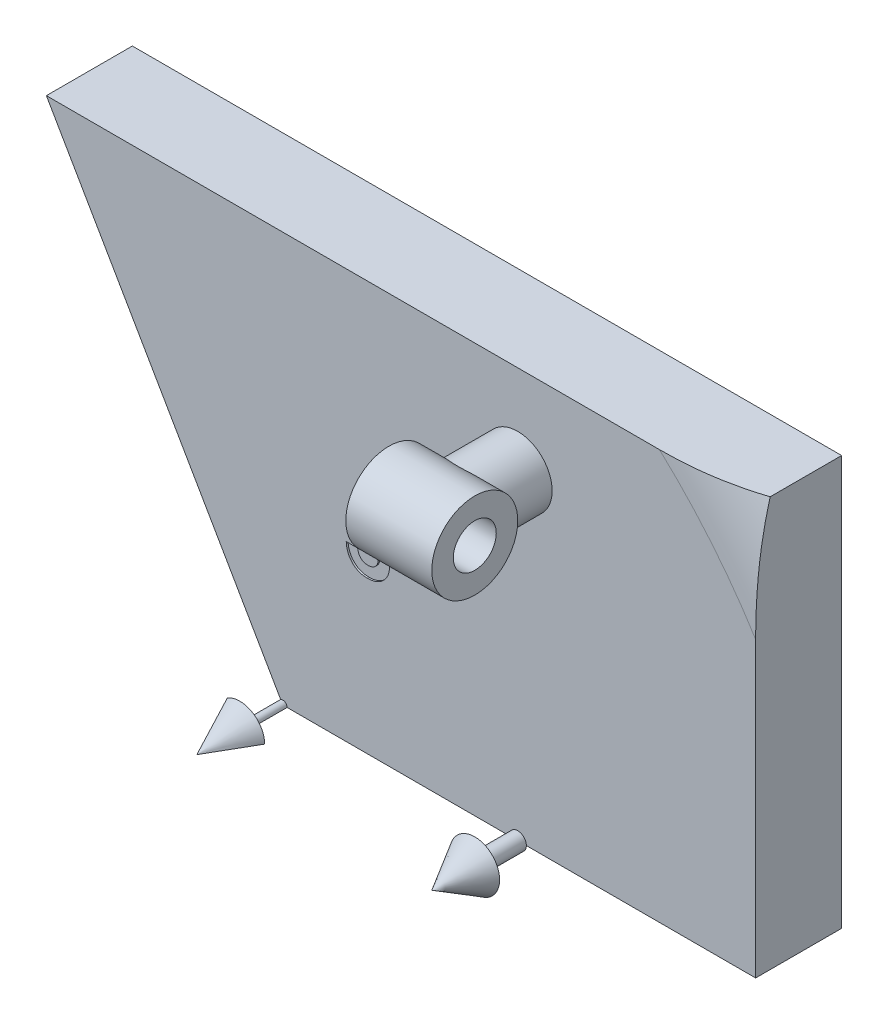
ISO-10303-21;
HEADER;
FILE_DESCRIPTION(('STEP AP214'),'2;1');
FILE_NAME('part.step','',(''),(''),'','','');
FILE_SCHEMA(('AUTOMOTIVE_DESIGN { 1 0 10303 214 1 1 1 1 }'));
ENDSEC;
DATA;
#1=APPLICATION_CONTEXT('core data for automotive mechanical design processes');
#2=APPLICATION_PROTOCOL_DEFINITION('international standard','automotive_design',2000,#1);
#3=PRODUCT_CONTEXT('',#1,'mechanical');
#4=PRODUCT('Part','Part','',(#3));
#5=PRODUCT_RELATED_PRODUCT_CATEGORY('part','',(#4));
#6=PRODUCT_DEFINITION_FORMATION('','',#4);
#7=PRODUCT_DEFINITION_CONTEXT('part definition',#1,'design');
#8=PRODUCT_DEFINITION('design','',#6,#7);
#9=PRODUCT_DEFINITION_SHAPE('','',#8);
#10=(LENGTH_UNIT() NAMED_UNIT(*) SI_UNIT(.MILLI.,.METRE.));
#11=(NAMED_UNIT(*) PLANE_ANGLE_UNIT() SI_UNIT($,.RADIAN.));
#12=(NAMED_UNIT(*) SI_UNIT($,.STERADIAN.) SOLID_ANGLE_UNIT());
#13=UNCERTAINTY_MEASURE_WITH_UNIT(LENGTH_MEASURE(1.E-05),#10,'distance_accuracy_value','');
#14=(GEOMETRIC_REPRESENTATION_CONTEXT(3) GLOBAL_UNCERTAINTY_ASSIGNED_CONTEXT((#13)) GLOBAL_UNIT_ASSIGNED_CONTEXT((#10,
#11,#12)) REPRESENTATION_CONTEXT('',''));
#15=CARTESIAN_POINT('',(0.,0.,0.));
#16=DIRECTION('',(0.,0.,1.));
#17=DIRECTION('',(1.,0.,0.));
#18=AXIS2_PLACEMENT_3D('',#15,#16,#17);
#19=CARTESIAN_POINT('',(55.,0.,10.));
#20=DIRECTION('',(0.,0.,-1.));
#21=DIRECTION('',(-1.,0.,0.));
#22=AXIS2_PLACEMENT_3D('',#19,#20,#21);
#23=PLANE('',#22);
#24=CARTESIAN_POINT('',(9.95078292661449,24.1470226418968,10.));
#25=CARTESIAN_POINT('',(9.90260398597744,24.1446511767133,10.));
#26=CARTESIAN_POINT('',(9.8070022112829,24.1399454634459,10.));
#27=CARTESIAN_POINT('',(9.66720380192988,24.1048232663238,10.));
#28=CARTESIAN_POINT('',(9.53444188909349,24.0456994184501,10.));
#29=CARTESIAN_POINT('',(9.41146559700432,23.9641711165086,10.));
#30=CARTESIAN_POINT('',(9.30005011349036,23.8662590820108,10.));
#31=CARTESIAN_POINT('',(9.20861014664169,23.7503026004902,10.));
#32=CARTESIAN_POINT('',(9.13255471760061,23.6232488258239,10.));
#33=CARTESIAN_POINT('',(9.1003168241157,23.5293821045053,10.));
#34=CARTESIAN_POINT('',(9.08410290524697,23.4821722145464,10.));
#35=B_SPLINE_CURVE_WITH_KNOTS('',3,(#24,#25,#26,#27,#28,#29,#30,#31,#32,#33,#34),.UNSPECIFIED.,
.F.,.F.,(4,1,1,1,1,1,1,1,4),(0.,0.123522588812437,0.245106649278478,0.367265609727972,
0.494690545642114,0.62232387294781,0.746002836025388,0.872253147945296,1.),.UNSPECIFIED.);
#36=CARTESIAN_POINT('',(9.95078292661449,24.1470226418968,10.));
#37=VERTEX_POINT('',#36);
#38=CARTESIAN_POINT('',(9.08410290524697,23.4821722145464,10.));
#39=VERTEX_POINT('',#38);
#40=EDGE_CURVE('E60',#37,#39,#35,.T.);
#41=ORIENTED_EDGE('',*,*,#40,.T.);
#42=DIRECTION('',(-1.,0.,0.));
#43=VECTOR('',#42,1.);
#44=CARTESIAN_POINT('',(9.08410290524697,23.4821722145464,10.));
#45=LINE('',#44,#43);
#46=CARTESIAN_POINT('',(7.75440205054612,23.4821722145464,10.));
#47=VERTEX_POINT('',#46);
#48=EDGE_CURVE('E320',#39,#47,#45,.T.);
#49=ORIENTED_EDGE('',*,*,#48,.T.);
#50=CARTESIAN_POINT('',(7.75440205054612,23.4821722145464,10.));
#51=CARTESIAN_POINT('',(7.76379024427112,23.5486392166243,10.));
#52=CARTESIAN_POINT('',(7.78219517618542,23.678943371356,10.));
#53=CARTESIAN_POINT('',(7.82623571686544,23.8675913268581,10.));
#54=CARTESIAN_POINT('',(7.87891295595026,24.0465368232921,10.));
#55=CARTESIAN_POINT('',(7.94467779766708,24.2152131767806,10.));
#56=CARTESIAN_POINT('',(8.0218092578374,24.3739208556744,10.));
#57=CARTESIAN_POINT('',(8.1095229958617,24.5232044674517,10.));
#58=CARTESIAN_POINT('',(8.20876723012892,24.6624232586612,10.));
#59=CARTESIAN_POINT('',(8.28483898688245,24.7462892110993,10.));
#60=CARTESIAN_POINT('',(8.32278980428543,24.7881284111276,10.));
#61=B_SPLINE_CURVE_WITH_KNOTS('',3,(#50,#51,#52,#53,#54,#55,#56,#57,#58,#59,#60),.UNSPECIFIED.,
.F.,.F.,(4,1,1,1,1,1,1,1,4),(0.,0.138934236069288,0.272371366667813,0.400701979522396,
0.524915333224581,0.646775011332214,0.765706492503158,0.883115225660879,1.),.UNSPECIFIED.);
#62=CARTESIAN_POINT('',(8.32278980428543,24.7881284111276,10.));
#63=VERTEX_POINT('',#62);
#64=EDGE_CURVE('E326',#47,#63,#61,.T.);
#65=ORIENTED_EDGE('',*,*,#64,.T.);
#66=CARTESIAN_POINT('',(8.32278980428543,24.7881284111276,10.));
#67=CARTESIAN_POINT('',(8.37752882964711,24.8433322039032,10.));
#68=CARTESIAN_POINT('',(8.48541369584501,24.9521330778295,10.));
#69=CARTESIAN_POINT('',(8.66570196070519,25.0914949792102,10.));
#70=CARTESIAN_POINT('',(8.85467735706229,25.2121032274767,10.));
#71=CARTESIAN_POINT('',(9.05612986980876,25.3077223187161,10.));
#72=CARTESIAN_POINT('',(9.26692474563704,25.3851148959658,10.));
#73=CARTESIAN_POINT('',(9.48873829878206,25.4370996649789,10.));
#74=CARTESIAN_POINT('',(9.72066411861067,25.4715920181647,10.));
#75=CARTESIAN_POINT('',(9.87892431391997,25.4749896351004,10.));
#76=CARTESIAN_POINT('',(9.95968717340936,25.4767234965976,10.));
#77=B_SPLINE_CURVE_WITH_KNOTS('',3,(#66,#67,#68,#69,#70,#71,#72,#73,#74,#75,#76),.UNSPECIFIED.,
.F.,.F.,(4,1,1,1,1,1,1,1,4),(0.,0.127406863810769,0.251105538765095,0.372907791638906,
0.494496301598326,0.616171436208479,0.740562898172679,0.867604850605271,1.),.UNSPECIFIED.);
#78=CARTESIAN_POINT('',(9.95968717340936,25.4767234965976,10.));
#79=VERTEX_POINT('',#78);
#80=EDGE_CURVE('E331',#63,#79,#77,.T.);
#81=ORIENTED_EDGE('',*,*,#80,.T.);
#82=CARTESIAN_POINT('',(9.95968717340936,25.4767234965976,10.));
#83=CARTESIAN_POINT('',(10.0314895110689,25.4750283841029,10.));
#84=CARTESIAN_POINT('',(10.1726384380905,25.4716961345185,10.));
#85=CARTESIAN_POINT('',(10.3800918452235,25.444946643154,10.));
#86=CARTESIAN_POINT('',(10.5778813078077,25.3980310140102,10.));
#87=CARTESIAN_POINT('',(10.7680975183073,25.3366898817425,10.));
#88=CARTESIAN_POINT('',(10.9479430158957,25.253225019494,10.));
#89=CARTESIAN_POINT('',(11.1213871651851,25.1563400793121,10.));
#90=CARTESIAN_POINT('',(11.2835839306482,25.037506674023,10.));
#91=CARTESIAN_POINT('',(11.4349128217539,24.9032368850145,10.));
#92=CARTESIAN_POINT('',(11.5739372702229,24.7580109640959,10.));
#93=CARTESIAN_POINT('',(11.6943330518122,24.6027763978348,10.));
#94=CARTESIAN_POINT('',(11.7978394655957,24.4416798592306,10.));
#95=CARTESIAN_POINT('',(11.8831150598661,24.2733829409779,10.));
#96=CARTESIAN_POINT('',(11.9486804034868,24.0976008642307,10.));
#97=CARTESIAN_POINT('',(11.9941846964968,23.9153490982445,10.));
#98=CARTESIAN_POINT('',(12.0239683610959,23.7270297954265,10.));
#99=CARTESIAN_POINT('',(12.0269355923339,23.5990317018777,10.));
#100=CARTESIAN_POINT('',(12.0284405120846,23.5341136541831,10.));
#101=B_SPLINE_CURVE_WITH_KNOTS('',3,(#82,#83,#84,#85,#86,#87,#88,#89,#90,#91,#92,#93,#94,#95,
#96,#97,#98,#99,#100),.UNSPECIFIED.,.F.,.F.,(4,1,1,1,1,1,1,1,1,1,1,1,1,1,1,1,4),(0.,
0.068213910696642,0.13409480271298,0.198285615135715,0.26116018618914,0.323634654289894,
0.386366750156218,0.449642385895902,0.514244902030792,0.578413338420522,0.640374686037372,
0.700614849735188,0.760103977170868,0.819298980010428,0.878465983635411,0.938360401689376,1.),.UNSPECIFIED.);
#102=CARTESIAN_POINT('',(12.0284405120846,23.5341136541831,10.));
#103=VERTEX_POINT('',#102);
#104=EDGE_CURVE('E339',#79,#103,#101,.T.);
#105=ORIENTED_EDGE('',*,*,#104,.T.);
#106=CARTESIAN_POINT('',(12.0284405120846,23.5341136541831,10.));
#107=CARTESIAN_POINT('',(12.0253523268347,23.4537180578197,10.));
#108=CARTESIAN_POINT('',(12.0192726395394,23.2954438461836,10.));
#109=CARTESIAN_POINT('',(11.9693844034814,23.0637977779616,10.));
#110=CARTESIAN_POINT('',(11.8912957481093,22.8423027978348,10.));
#111=CARTESIAN_POINT('',(11.7784890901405,22.6340579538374,10.));
#112=CARTESIAN_POINT('',(11.6374520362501,22.4396299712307,10.));
#113=CARTESIAN_POINT('',(11.4644042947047,22.2655191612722,10.));
#114=CARTESIAN_POINT('',(11.2642747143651,22.1089957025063,10.));
#115=CARTESIAN_POINT('',(11.114034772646,22.0248799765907,10.));
#116=CARTESIAN_POINT('',(11.0371010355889,21.9818066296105,10.));
#117=B_SPLINE_CURVE_WITH_KNOTS('',3,(#106,#107,#108,#109,#110,#111,#112,#113,#114,#115,#116),
.UNSPECIFIED.,.F.,.F.,(4,1,1,1,1,1,1,1,4),(0.,0.124100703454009,0.244316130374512,
0.364465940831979,0.485853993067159,0.608914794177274,0.734300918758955,0.863942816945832,1.),.UNSPECIFIED.);
#118=CARTESIAN_POINT('',(11.0371010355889,21.9818066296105,10.));
#119=VERTEX_POINT('',#118);
#120=EDGE_CURVE('E347',#103,#119,#117,.T.);
#121=ORIENTED_EDGE('',*,*,#120,.T.);
#122=CARTESIAN_POINT('',(11.0371010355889,21.9818066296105,10.));
#123=CARTESIAN_POINT('',(11.0899071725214,21.9644692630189,10.));
#124=CARTESIAN_POINT('',(11.1936688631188,21.9304021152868,10.));
#125=CARTESIAN_POINT('',(11.3411536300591,21.8633072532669,10.));
#126=CARTESIAN_POINT('',(11.4813947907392,21.7899836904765,10.));
#127=CARTESIAN_POINT('',(11.6119774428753,21.7048010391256,10.));
#128=CARTESIAN_POINT('',(11.7342003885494,21.611203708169,10.));
#129=CARTESIAN_POINT('',(11.8473185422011,21.5083915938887,10.));
#130=CARTESIAN_POINT('',(11.9520077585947,21.3965888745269,10.));
#131=CARTESIAN_POINT('',(12.0465590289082,21.2751806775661,10.));
#132=CARTESIAN_POINT('',(12.1304769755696,21.1461086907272,10.));
#133=CARTESIAN_POINT('',(12.205772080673,21.0123544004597,10.));
#134=CARTESIAN_POINT('',(12.267744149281,20.871889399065,9.99999999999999));
#135=CARTESIAN_POINT('',(12.3202422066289,20.7263178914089,10.));
#136=CARTESIAN_POINT('',(12.3602112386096,20.5743315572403,10.));
#137=CARTESIAN_POINT('',(12.3883530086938,20.416519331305,10.));
#138=CARTESIAN_POINT('',(12.4046196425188,20.2532411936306,10.));
#139=CARTESIAN_POINT('',(12.4071005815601,20.1426203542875,10.));
#140=CARTESIAN_POINT('',(12.4083550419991,20.0866861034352,10.));
#141=B_SPLINE_CURVE_WITH_KNOTS('',3,(#122,#123,#124,#125,#126,#127,#128,#129,#130,#131,#132,
#133,#134,#135,#136,#137,#138,#139,#140),.UNSPECIFIED.,.F.,.F.,(4,1,1,1,1,1,1,1,1,1,1,1,1,1,1,1,
4),(0.,0.0662214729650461,0.130122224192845,0.192921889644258,0.254764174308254,
0.315756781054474,0.376302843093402,0.436814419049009,0.498168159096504,0.559516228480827,
0.620243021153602,0.680969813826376,0.742349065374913,0.804583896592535,0.868102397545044,
0.933307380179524,1.),.UNSPECIFIED.);
#142=CARTESIAN_POINT('',(12.4083550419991,20.0866861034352,10.));
#143=VERTEX_POINT('',#142);
#144=EDGE_CURVE('E355',#119,#143,#141,.T.);
#145=ORIENTED_EDGE('',*,*,#144,.T.);
#146=CARTESIAN_POINT('',(12.4083550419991,20.0866861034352,10.));
#147=CARTESIAN_POINT('',(12.405812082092,20.0044854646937,10.));
#148=CARTESIAN_POINT('',(12.4007978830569,19.8424025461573,10.));
#149=CARTESIAN_POINT('',(12.3689199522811,19.6036709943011,10.));
#150=CARTESIAN_POINT('',(12.3095689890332,19.3760616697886,10.));
#151=CARTESIAN_POINT('',(12.2314895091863,19.1569555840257,10.));
#152=CARTESIAN_POINT('',(12.1273399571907,18.9491813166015,10.));
#153=CARTESIAN_POINT('',(12.0047734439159,18.7479707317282,10.));
#154=CARTESIAN_POINT('',(11.8541145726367,18.5603017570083,10.));
#155=CARTESIAN_POINT('',(11.6866831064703,18.3812129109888,10.));
#156=CARTESIAN_POINT('',(11.5007407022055,18.2183933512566,10.));
#157=CARTESIAN_POINT('',(11.2991488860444,18.0772361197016,10.));
#158=CARTESIAN_POINT('',(11.0863404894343,17.9560981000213,10.));
#159=CARTESIAN_POINT('',(10.8609691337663,17.8577548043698,10.));
#160=CARTESIAN_POINT('',(10.623113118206,17.7820192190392,10.));
#161=CARTESIAN_POINT('',(10.3733026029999,17.7272740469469,10.));
#162=CARTESIAN_POINT('',(10.1104879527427,17.693780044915,10.));
#163=CARTESIAN_POINT('',(9.93109639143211,17.6902688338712,10.));
#164=CARTESIAN_POINT('',(9.83947984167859,17.6884756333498,10.));
#165=B_SPLINE_CURVE_WITH_KNOTS('',3,(#146,#147,#148,#149,#150,#151,#152,#153,#154,#155,#156,
#157,#158,#159,#160,#161,#162,#163,#164),.UNSPECIFIED.,.F.,.F.,(4,1,1,1,1,1,1,1,1,1,1,1,1,1,1,1,
4),(0.,0.0628211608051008,0.12387053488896,0.183554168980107,0.242266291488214,
0.301264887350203,0.360846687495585,0.421948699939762,0.484789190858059,0.548013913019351,
0.610412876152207,0.672536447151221,0.734828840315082,0.797947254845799,0.86297349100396,
0.930019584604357,1.),.UNSPECIFIED.);
#166=CARTESIAN_POINT('',(9.83947984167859,17.6884756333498,10.));
#167=VERTEX_POINT('',#166);
#168=EDGE_CURVE('E363',#143,#167,#165,.T.);
#169=ORIENTED_EDGE('',*,*,#168,.T.);
#170=CARTESIAN_POINT('',(9.83947984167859,17.6884756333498,10.));
#171=CARTESIAN_POINT('',(9.75281206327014,17.6903662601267,10.));
#172=CARTESIAN_POINT('',(9.58334469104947,17.6940631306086,10.));
#173=CARTESIAN_POINT('',(9.33546319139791,17.7260614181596,10.));
#174=CARTESIAN_POINT('',(9.09987528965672,17.7776772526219,10.));
#175=CARTESIAN_POINT('',(8.87597976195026,17.8504340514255,10.));
#176=CARTESIAN_POINT('',(8.66464284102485,17.9447871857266,10.));
#177=CARTESIAN_POINT('',(8.46394804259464,18.0571405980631,10.));
#178=CARTESIAN_POINT('',(8.27790018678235,18.1939745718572,10.));
#179=CARTESIAN_POINT('',(8.10442633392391,18.3491121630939,10.));
#180=CARTESIAN_POINT('',(7.94737465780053,18.5231677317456,10.));
#181=CARTESIAN_POINT('',(7.80700744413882,18.7121093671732,10.));
#182=CARTESIAN_POINT('',(7.68641981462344,18.9166555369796,10.));
#183=CARTESIAN_POINT('',(7.58511723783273,19.1359323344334,10.));
#184=CARTESIAN_POINT('',(7.50389167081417,19.3703244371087,10.));
#185=CARTESIAN_POINT('',(7.43982118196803,19.6193551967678,10.));
#186=CARTESIAN_POINT('',(7.39506689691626,19.883511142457,10.));
#187=CARTESIAN_POINT('',(7.3814368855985,20.0652560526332,10.));
#188=CARTESIAN_POINT('',(7.37448752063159,20.1579200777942,10.));
#189=B_SPLINE_CURVE_WITH_KNOTS('',3,(#170,#171,#172,#173,#174,#175,#176,#177,#178,#179,#180,
#181,#182,#183,#184,#185,#186,#187,#188),.UNSPECIFIED.,.F.,.F.,(4,1,1,1,1,1,1,1,1,1,1,1,1,1,1,1,
4),(0.,0.0666590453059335,0.130342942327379,0.191936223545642,0.251995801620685,
0.311121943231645,0.369754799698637,0.428602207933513,0.488435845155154,0.548524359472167,
0.608661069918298,0.669235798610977,0.730880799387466,0.794196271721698,0.859830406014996,
0.928533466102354,1.),.UNSPECIFIED.);
#190=CARTESIAN_POINT('',(7.37448752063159,20.1579200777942,10.));
#191=VERTEX_POINT('',#190);
#192=EDGE_CURVE('E371',#167,#191,#189,.T.);
#193=ORIENTED_EDGE('',*,*,#192,.T.);
#194=DIRECTION('',(1.,0.,0.));
#195=VECTOR('',#194,1.);
#196=CARTESIAN_POINT('',(7.37448752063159,20.1579200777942,10.));
#197=LINE('',#196,#195);
#198=CARTESIAN_POINT('',(8.70418837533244,20.1579200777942,10.));
#199=VERTEX_POINT('',#198);
#200=EDGE_CURVE('E379',#191,#199,#197,.T.);
#201=ORIENTED_EDGE('',*,*,#200,.T.);
#202=CARTESIAN_POINT('',(8.70418837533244,20.1579200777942,10.));
#203=CARTESIAN_POINT('',(8.71261455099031,20.1113273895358,10.));
#204=CARTESIAN_POINT('',(8.72902673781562,20.0205759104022,10.));
#205=CARTESIAN_POINT('',(8.76103770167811,19.8891879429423,10.));
#206=CARTESIAN_POINT('',(8.80275245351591,19.7679087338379,10.));
#207=CARTESIAN_POINT('',(8.85098508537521,19.6556603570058,10.));
#208=CARTESIAN_POINT('',(8.90308358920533,19.5509690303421,10.));
#209=CARTESIAN_POINT('',(8.96603104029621,19.457701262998,10.));
#210=CARTESIAN_POINT('',(9.0352149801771,19.3733244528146,10.));
#211=CARTESIAN_POINT('',(9.13504790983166,19.2730163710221,10.));
#212=CARTESIAN_POINT('',(9.27776595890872,19.1699540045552,10.));
#213=CARTESIAN_POINT('',(9.47048260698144,19.0803879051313,10.));
#214=CARTESIAN_POINT('',(9.68486162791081,19.0278911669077,10.));
#215=CARTESIAN_POINT('',(9.83473394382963,19.0214867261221,10.));
#216=CARTESIAN_POINT('',(9.91219785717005,19.0181764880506,10.));
#217=B_SPLINE_CURVE_WITH_KNOTS('',3,(#202,#203,#204,#205,#206,#207,#208,#209,#210,#211,#212,
#213,#214,#215,#216),.UNSPECIFIED.,.F.,.F.,(4,1,1,1,1,1,1,1,1,1,1,1,4),(0.,0.0773463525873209,
0.150652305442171,0.220677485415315,0.286575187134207,0.350188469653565,0.411378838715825,
0.469946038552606,0.528233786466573,0.642194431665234,0.755364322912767,0.873556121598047,1.),.UNSPECIFIED.);
#218=CARTESIAN_POINT('',(9.91219785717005,19.0181764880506,10.));
#219=VERTEX_POINT('',#218);
#220=EDGE_CURVE('E385',#199,#219,#217,.T.);
#221=ORIENTED_EDGE('',*,*,#220,.T.);
#222=CARTESIAN_POINT('',(9.91219785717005,19.0181764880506,10.));
#223=CARTESIAN_POINT('',(9.95330294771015,19.0188813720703,10.));
#224=CARTESIAN_POINT('',(10.0338186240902,19.0202620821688,10.));
#225=CARTESIAN_POINT('',(10.1520841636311,19.0355654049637,10.));
#226=CARTESIAN_POINT('',(10.2647487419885,19.0607699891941,10.));
#227=CARTESIAN_POINT('',(10.372022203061,19.0950220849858,10.));
#228=CARTESIAN_POINT('',(10.4745874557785,19.1379592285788,10.));
#229=CARTESIAN_POINT('',(10.5704848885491,19.1933241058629,10.));
#230=CARTESIAN_POINT('',(10.6616691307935,19.2576936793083,10.));
#231=CARTESIAN_POINT('',(10.7471489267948,19.3300621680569,10.));
#232=CARTESIAN_POINT('',(10.826134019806,19.4089179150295,10.));
#233=CARTESIAN_POINT('',(10.8918542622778,19.496237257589,10.));
#234=CARTESIAN_POINT('',(10.9519178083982,19.584969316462,10.));
#235=CARTESIAN_POINT('',(10.9963412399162,19.680919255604,10.));
#236=CARTESIAN_POINT('',(11.0352657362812,19.7789239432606,10.));
#237=CARTESIAN_POINT('',(11.059089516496,19.882540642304,10.));
#238=CARTESIAN_POINT('',(11.0770781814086,19.9895957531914,10.));
#239=CARTESIAN_POINT('',(11.0781236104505,20.0628595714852,10.));
#240=CARTESIAN_POINT('',(11.0786541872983,20.1000424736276,10.));
#241=B_SPLINE_CURVE_WITH_KNOTS('',3,(#222,#223,#224,#225,#226,#227,#228,#229,#230,#231,#232,
#233,#234,#235,#236,#237,#238,#239,#240),.UNSPECIFIED.,.F.,.F.,(4,1,1,1,1,1,1,1,1,1,1,1,1,1,1,1,
4),(0.,0.069402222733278,0.135943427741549,0.201020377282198,0.264180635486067,
0.325954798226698,0.388453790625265,0.45081856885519,0.514265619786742,0.577492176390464,
0.638835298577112,0.698633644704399,0.758057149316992,0.817032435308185,0.876414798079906,
0.937277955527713,1.),.UNSPECIFIED.);
#242=CARTESIAN_POINT('',(11.0786541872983,20.1000424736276,10.));
#243=VERTEX_POINT('',#242);
#244=EDGE_CURVE('E390',#219,#243,#241,.T.);
#245=ORIENTED_EDGE('',*,*,#244,.T.);
#246=CARTESIAN_POINT('',(11.0786541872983,20.1000424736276,10.));
#247=CARTESIAN_POINT('',(11.0772456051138,20.1407083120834,10.));
#248=CARTESIAN_POINT('',(11.0744414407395,20.2216646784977,10.));
#249=CARTESIAN_POINT('',(11.0515311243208,20.3398034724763,10.));
#250=CARTESIAN_POINT('',(11.0153508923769,20.4534434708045,10.));
#251=CARTESIAN_POINT('',(10.965092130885,20.56208142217,10.));
#252=CARTESIAN_POINT('',(10.8979771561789,20.6653169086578,10.));
#253=CARTESIAN_POINT('',(10.8187822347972,20.765221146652,10.));
#254=CARTESIAN_POINT('',(10.7212681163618,20.8565942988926,10.));
#255=CARTESIAN_POINT('',(10.614282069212,20.9469138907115,10.));
#256=CARTESIAN_POINT('',(10.4902202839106,21.0256453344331,10.));
#257=CARTESIAN_POINT('',(10.3551247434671,21.0983028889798,10.));
#258=CARTESIAN_POINT('',(10.2054449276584,21.1561158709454,10.));
#259=CARTESIAN_POINT('',(10.0448346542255,21.2077535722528,10.));
#260=CARTESIAN_POINT('',(9.87025582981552,21.245468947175,10.));
#261=CARTESIAN_POINT('',(9.68279252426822,21.2728539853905,10.));
#262=CARTESIAN_POINT('',(9.48274714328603,21.2932379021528,10.));
#263=CARTESIAN_POINT('',(9.34485326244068,21.2961623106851,10.));
#264=CARTESIAN_POINT('',(9.27406017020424,21.2976636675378,10.));
#265=B_SPLINE_CURVE_WITH_KNOTS('',3,(#246,#247,#248,#249,#250,#251,#252,#253,#254,#255,#256,
#257,#258,#259,#260,#261,#262,#263,#264),.UNSPECIFIED.,.F.,.F.,(4,1,1,1,1,1,1,1,1,1,1,1,1,1,1,1,
4),(0.,0.0506134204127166,0.100759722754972,0.149274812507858,0.198888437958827,
0.249306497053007,0.302322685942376,0.35722064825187,0.415437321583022,0.476442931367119,
0.539828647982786,0.606183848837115,0.67594120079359,0.749782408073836,0.828287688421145,
0.911844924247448,1.),.UNSPECIFIED.);
#266=CARTESIAN_POINT('',(9.27406017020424,21.2976636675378,10.));
#267=VERTEX_POINT('',#266);
#268=EDGE_CURVE('E398',#243,#267,#265,.T.);
#269=ORIENTED_EDGE('',*,*,#268,.T.);
#270=DIRECTION('',(0.,1.,0.));
#271=VECTOR('',#270,1.);
#272=CARTESIAN_POINT('',(9.27406017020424,21.2976636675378,10.));
#273=LINE('',#272,#271);
#274=CARTESIAN_POINT('',(9.27406017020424,22.53238588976,10.));
#275=VERTEX_POINT('',#274);
#276=EDGE_CURVE('E406',#267,#275,#273,.T.);
#277=ORIENTED_EDGE('',*,*,#276,.T.);
#278=CARTESIAN_POINT('',(9.27406017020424,22.53238588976,10.));
#279=CARTESIAN_POINT('',(9.36220178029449,22.5398923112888,10.));
#280=CARTESIAN_POINT('',(9.52709727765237,22.5539353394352,10.));
#281=CARTESIAN_POINT('',(9.75598106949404,22.5867754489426,10.));
#282=CARTESIAN_POINT('',(9.948671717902,22.6306716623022,10.));
#283=CARTESIAN_POINT('',(10.1098005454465,22.6836300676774,10.));
#284=CARTESIAN_POINT('',(10.2435915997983,22.7516424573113,10.));
#285=CARTESIAN_POINT('',(10.3604707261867,22.8267251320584,10.));
#286=CARTESIAN_POINT('',(10.461132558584,22.9139226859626,10.));
#287=CARTESIAN_POINT('',(10.5462053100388,23.0106348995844,10.));
#288=CARTESIAN_POINT('',(10.6142608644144,23.1144947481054,10.));
#289=CARTESIAN_POINT('',(10.6624266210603,23.2238879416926,10.));
#290=CARTESIAN_POINT('',(10.6942327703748,23.3354297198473,10.));
#291=CARTESIAN_POINT('',(10.6972464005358,23.4117209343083,10.));
#292=CARTESIAN_POINT('',(10.6987396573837,23.4495233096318,10.));
#293=B_SPLINE_CURVE_WITH_KNOTS('',3,(#278,#279,#280,#281,#282,#283,#284,#285,#286,#287,#288,
#289,#290,#291,#292),.UNSPECIFIED.,.F.,.F.,(4,1,1,1,1,1,1,1,1,1,1,1,4),(0.,0.141703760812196,
0.265099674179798,0.370057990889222,0.458023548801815,0.535993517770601,0.609847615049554,
0.680075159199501,0.748587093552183,0.81563036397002,0.878070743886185,0.939583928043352,1.),.UNSPECIFIED.);
#294=CARTESIAN_POINT('',(10.6987396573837,23.4495233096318,10.));
#295=VERTEX_POINT('',#294);
#296=EDGE_CURVE('E412',#275,#295,#293,.T.);
#297=ORIENTED_EDGE('',*,*,#296,.T.);
#298=CARTESIAN_POINT('',(10.6987396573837,23.4495233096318,10.));
#299=CARTESIAN_POINT('',(10.6961633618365,23.4977550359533,10.));
#300=CARTESIAN_POINT('',(10.6911349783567,23.5918931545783,10.));
#301=CARTESIAN_POINT('',(10.6520818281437,23.7266246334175,10.));
#302=CARTESIAN_POINT('',(10.5842899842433,23.846726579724,10.));
#303=CARTESIAN_POINT('',(10.4933930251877,23.951946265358,10.));
#304=CARTESIAN_POINT('',(10.3826319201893,24.0398336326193,10.));
#305=CARTESIAN_POINT('',(10.2528004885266,24.1036383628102,10.));
#306=CARTESIAN_POINT('',(10.1067160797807,24.1411264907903,10.));
#307=CARTESIAN_POINT('',(10.0039378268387,24.1450127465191,10.));
#308=CARTESIAN_POINT('',(9.95078292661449,24.1470226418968,10.));
#309=B_SPLINE_CURVE_WITH_KNOTS('',3,(#298,#299,#300,#301,#302,#303,#304,#305,#306,#307,#308),
.UNSPECIFIED.,.F.,.F.,(4,1,1,1,1,1,1,1,4),(0.,0.126208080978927,0.246331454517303,
0.363483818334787,0.484754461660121,0.608382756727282,0.731214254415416,0.860989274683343,1.),.UNSPECIFIED.);
#310=EDGE_CURVE('E417',#295,#37,#309,.T.);
#311=ORIENTED_EDGE('',*,*,#310,.T.);
#312=EDGE_LOOP('',(#41,#49,#65,#81,#105,#121,#145,#169,#193,#201,#221,#245,#269,#277,#297,#311));
#313=FACE_BOUND('',#312,.T.);
#314=CARTESIAN_POINT('',(27.33,37.23,9.99999999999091));
#315=DIRECTION('',(0.,0.,-1.));
#316=DIRECTION('',(-1.,0.,0.));
#317=AXIS2_PLACEMENT_3D('',#314,#315,#316);
#318=CIRCLE('',#317,4.00000000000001);
#319=CARTESIAN_POINT('',(23.33,37.23,9.99999999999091));
#320=VERTEX_POINT('',#319);
#321=EDGE_CURVE('E46',#320,#320,#318,.F.);
#322=ORIENTED_EDGE('',*,*,#321,.F.);
#323=EDGE_LOOP('',(#322));
#324=FACE_BOUND('',#323,.T.);
#325=CARTESIAN_POINT('',(0.,0.,10.));
#326=DIRECTION('',(0.,0.,-1.));
#327=DIRECTION('',(-1.,0.,0.));
#328=AXIS2_PLACEMENT_3D('',#325,#326,#327);
#329=CIRCLE('',#328,64.7157287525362);
#330=CARTESIAN_POINT('',(43.8106784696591,47.631397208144,10.));
#331=VERTEX_POINT('',#330);
#332=CARTESIAN_POINT('',(55.,34.1046264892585,10.));
#333=VERTEX_POINT('',#332);
#334=EDGE_CURVE('E208',#331,#333,#329,.T.);
#335=ORIENTED_EDGE('',*,*,#334,.F.);
#336=DIRECTION('',(-1.,0.,0.));
#337=VECTOR('',#336,1.);
#338=CARTESIAN_POINT('',(-27.5000000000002,47.631397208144,10.));
#339=LINE('',#338,#337);
#340=CARTESIAN_POINT('',(-27.5000000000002,47.631397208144,10.));
#341=VERTEX_POINT('',#340);
#342=EDGE_CURVE('E214',#331,#341,#339,.T.);
#343=ORIENTED_EDGE('',*,*,#342,.T.);
#344=DIRECTION('',(0.500000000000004,-0.866025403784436,0.));
#345=VECTOR('',#344,1.);
#346=CARTESIAN_POINT('',(-27.5000000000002,47.631397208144,10.));
#347=LINE('',#346,#345);
#348=CARTESIAN_POINT('',(-0.25,0.433012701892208,10.));
#349=VERTEX_POINT('',#348);
#350=EDGE_CURVE('E223',#341,#349,#347,.T.);
#351=ORIENTED_EDGE('',*,*,#350,.T.);
#352=CARTESIAN_POINT('',(0.,0.,10.));
#353=DIRECTION('',(0.,0.,-1.));
#354=DIRECTION('',(-1.,0.,0.));
#355=AXIS2_PLACEMENT_3D('',#352,#353,#354);
#356=CIRCLE('',#355,0.5);
#357=CARTESIAN_POINT('',(0.5,0.,10.));
#358=VERTEX_POINT('',#357);
#359=EDGE_CURVE('E487',#349,#358,#356,.T.);
#360=ORIENTED_EDGE('',*,*,#359,.T.);
#361=DIRECTION('',(1.,0.,0.));
#362=VECTOR('',#361,1.);
#363=CARTESIAN_POINT('',(0.,0.,10.));
#364=LINE('',#363,#362);
#365=CARTESIAN_POINT('',(26.33,0.,10.));
#366=VERTEX_POINT('',#365);
#367=EDGE_CURVE('E227',#358,#366,#364,.T.);
#368=ORIENTED_EDGE('',*,*,#367,.T.);
#369=CARTESIAN_POINT('',(27.33,0.,10.));
#370=DIRECTION('',(0.,0.,-1.));
#371=DIRECTION('',(0.,1.,0.));
#372=AXIS2_PLACEMENT_3D('',#369,#370,#371);
#373=CIRCLE('',#372,1.);
#374=CARTESIAN_POINT('',(28.33,0.,10.));
#375=VERTEX_POINT('',#374);
#376=EDGE_CURVE('E465',#366,#375,#373,.T.);
#377=ORIENTED_EDGE('',*,*,#376,.T.);
#378=CARTESIAN_POINT('',(55.,0.,10.));
#379=VERTEX_POINT('',#378);
#380=EDGE_CURVE('E242',#375,#379,#364,.T.);
#381=ORIENTED_EDGE('',*,*,#380,.T.);
#382=DIRECTION('',(0.,1.,0.));
#383=VECTOR('',#382,1.);
#384=CARTESIAN_POINT('',(55.,47.631397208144,10.));
#385=LINE('',#384,#383);
#386=EDGE_CURVE('E217',#379,#333,#385,.T.);
#387=ORIENTED_EDGE('',*,*,#386,.T.);
#388=EDGE_LOOP('',(#335,#343,#351,#360,#368,#377,#381,#387));
#389=FACE_BOUND('',#388,.T.);
#390=ADVANCED_FACE('F34',(#313,#324,#389),#23,.F.);
#391=CARTESIAN_POINT('',(55.,47.631397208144,10.));
#392=DIRECTION('',(-1.,0.,0.));
#393=DIRECTION('',(0.,-1.,0.));
#394=AXIS2_PLACEMENT_3D('',#391,#392,#393);
#395=PLANE('',#394);
#396=CARTESIAN_POINT('',(54.9999999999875,23.5563264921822,9.39463403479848));
#397=CARTESIAN_POINT('',(54.9999999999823,25.6260070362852,9.59980524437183));
#398=CARTESIAN_POINT('',(54.9999999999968,27.6993537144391,9.77357032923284));
#399=CARTESIAN_POINT('',(55.0000000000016,30.8161041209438,9.93573209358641));
#400=CARTESIAN_POINT('',(55.0000000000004,31.8568051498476,9.9733642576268));
#401=CARTESIAN_POINT('',(54.9999999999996,33.9388273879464,10.0069260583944));
#402=CARTESIAN_POINT('',(54.9999999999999,34.980148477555,10.0028620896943));
#403=CARTESIAN_POINT('',(55.0000000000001,37.0469578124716,9.944469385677));
#404=CARTESIAN_POINT('',(55.,38.0724633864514,9.8908460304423));
#405=CARTESIAN_POINT('',(55.,39.6072753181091,9.7667727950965));
#406=CARTESIAN_POINT('',(55.,40.1183395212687,9.71813722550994));
#407=CARTESIAN_POINT('',(55.,41.1387581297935,9.60518449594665));
#408=CARTESIAN_POINT('',(55.,41.6481118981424,9.54086203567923));
#409=CARTESIAN_POINT('',(55.,44.182412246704,9.17797511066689));
#410=CARTESIAN_POINT('',(55.,46.1942685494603,8.75319607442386));
#411=CARTESIAN_POINT('',(55.,48.7305324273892,7.98177181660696));
#412=CARTESIAN_POINT('',(55.,49.3043480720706,7.790897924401));
#413=CARTESIAN_POINT('',(55.,50.44055541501,7.37729840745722));
#414=CARTESIAN_POINT('',(55.,51.0029471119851,7.15457277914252));
#415=CARTESIAN_POINT('',(55.,52.1144583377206,6.67498863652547));
#416=CARTESIAN_POINT('',(55.,52.6635465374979,6.41805735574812));
#417=CARTESIAN_POINT('',(55.,53.7439302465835,5.86869991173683));
#418=CARTESIAN_POINT('',(55.,54.2752211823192,5.57626471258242));
#419=CARTESIAN_POINT('',(55.,55.3197602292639,4.95223183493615));
#420=CARTESIAN_POINT('',(55.,55.8328442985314,4.6203584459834));
#421=CARTESIAN_POINT('',(55.,56.8318897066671,3.91831467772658));
#422=CARTESIAN_POINT('',(55.,57.3178627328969,3.54816100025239));
#423=CARTESIAN_POINT('',(55.,58.2571586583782,2.76936735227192));
#424=CARTESIAN_POINT('',(55.,58.7105161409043,2.36076923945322));
#425=CARTESIAN_POINT('',(55.,59.5792875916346,1.50504110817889));
#426=CARTESIAN_POINT('',(55.,59.9947110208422,1.05792075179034));
#427=CARTESIAN_POINT('',(55.,60.6997105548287,0.223123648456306));
#428=CARTESIAN_POINT('',(55.,60.9975091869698,-0.157624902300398));
#429=CARTESIAN_POINT('',(55.,61.5621507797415,-0.941384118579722));
#430=CARTESIAN_POINT('',(55.,61.8290003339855,-1.34439001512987));
#431=CARTESIAN_POINT('',(55.,62.328525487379,-2.17101876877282));
#432=CARTESIAN_POINT('',(55.,62.5612061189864,-2.59463857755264));
#433=CARTESIAN_POINT('',(55.,62.9893275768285,-3.46035621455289));
#434=CARTESIAN_POINT('',(55.,63.1847677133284,-3.90245438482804));
#435=CARTESIAN_POINT('',(55.,63.5365818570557,-4.80502589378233));
#436=CARTESIAN_POINT('',(55.,63.6927151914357,-5.26559332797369));
#437=CARTESIAN_POINT('',(55.,63.961882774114,-6.19919570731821));
#438=CARTESIAN_POINT('',(55.,64.0749166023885,-6.67223077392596));
#439=CARTESIAN_POINT('',(55.,64.2559301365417,-7.62668699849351));
#440=CARTESIAN_POINT('',(55.,64.3239261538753,-8.10810505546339));
#441=CARTESIAN_POINT('',(55.,64.4137198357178,-9.07521518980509));
#442=CARTESIAN_POINT('',(55.,64.4355217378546,-9.56090687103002));
#443=CARTESIAN_POINT('',(55.,64.432704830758,-10.4841977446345));
#444=CARTESIAN_POINT('',(55.,64.4124518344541,-10.9218162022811));
#445=CARTESIAN_POINT('',(55.,64.3344207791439,-11.7936661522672));
#446=CARTESIAN_POINT('',(55.,64.2766456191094,-12.2278979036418));
#447=CARTESIAN_POINT('',(55.,64.1244062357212,-13.0898348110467));
#448=CARTESIAN_POINT('',(55.,64.0299442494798,-13.5175403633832));
#449=CARTESIAN_POINT('',(55.,63.8056426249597,-14.3635619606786));
#450=CARTESIAN_POINT('',(55.,63.675802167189,-14.7818777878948));
#451=CARTESIAN_POINT('',(55.,63.3835166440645,-15.6035501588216));
#452=CARTESIAN_POINT('',(55.,63.2213120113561,-16.0069924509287));
#453=CARTESIAN_POINT('',(55.,62.8657177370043,-16.7998512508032));
#454=CARTESIAN_POINT('',(55.,62.6723286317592,-17.1892679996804));
#455=CARTESIAN_POINT('',(55.,62.2565883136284,-17.9522174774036));
#456=CARTESIAN_POINT('',(55.,62.034241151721,-18.3257524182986));
#457=CARTESIAN_POINT('',(55.,61.5628570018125,-19.055604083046));
#458=CARTESIAN_POINT('',(55.,61.3138165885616,-19.4119185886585));
#459=CARTESIAN_POINT('',(55.,60.7639114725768,-20.1427743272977));
#460=CARTESIAN_POINT('',(55.,60.46035102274,-20.5152869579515));
#461=CARTESIAN_POINT('',(55.,59.8266744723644,-21.2369414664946));
#462=CARTESIAN_POINT('',(55.,59.4965572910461,-21.5860823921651));
#463=CARTESIAN_POINT('',(55.,58.8124140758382,-22.2608361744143));
#464=CARTESIAN_POINT('',(55.,58.4583619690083,-22.5864225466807));
#465=CARTESIAN_POINT('',(55.,57.7295076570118,-23.2135117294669));
#466=CARTESIAN_POINT('',(55.,57.3547013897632,-23.5150097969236));
#467=CARTESIAN_POINT('',(55.,56.3755522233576,-24.253494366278));
#468=CARTESIAN_POINT('',(55.,55.7584587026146,-24.6736722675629));
#469=CARTESIAN_POINT('',(55.,54.4895650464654,-25.4579521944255));
#470=CARTESIAN_POINT('',(55.,53.8377495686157,-25.8220291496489));
#471=CARTESIAN_POINT('',(55.,52.5073464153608,-26.4963983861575));
#472=CARTESIAN_POINT('',(55.,51.8287705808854,-26.8067141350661));
#473=CARTESIAN_POINT('',(55.,50.4509674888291,-27.3768325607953));
#474=CARTESIAN_POINT('',(55.,49.7517415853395,-27.6366385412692));
#475=CARTESIAN_POINT('',(55.,47.9531469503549,-28.2377633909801));
#476=CARTESIAN_POINT('',(55.,46.8428772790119,-28.5466226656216));
#477=CARTESIAN_POINT('',(55.,44.5993149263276,-29.0657457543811));
#478=CARTESIAN_POINT('',(55.,43.4660050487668,-29.2759328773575));
#479=CARTESIAN_POINT('',(55.,41.1804235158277,-29.6118405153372));
#480=CARTESIAN_POINT('',(55.,40.0280798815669,-29.7370621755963));
#481=CARTESIAN_POINT('',(55.,38.2960967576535,-29.8699249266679));
#482=CARTESIAN_POINT('',(55.,37.7183510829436,-29.9050487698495));
#483=CARTESIAN_POINT('',(55.,36.5621962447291,-29.9586063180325));
#484=CARTESIAN_POINT('',(55.,35.9837872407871,-29.9770434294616));
#485=CARTESIAN_POINT('',(55.,34.1501747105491,-30.011544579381));
#486=CARTESIAN_POINT('',(55.,32.8944177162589,-29.9996263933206));
#487=CARTESIAN_POINT('',(55.,30.3845614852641,-29.9203444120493));
#488=CARTESIAN_POINT('',(55.,29.1304629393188,-29.8529621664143));
#489=CARTESIAN_POINT('',(55.,26.6232022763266,-29.6778136));
#490=CARTESIAN_POINT('',(55.,25.3700448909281,-29.5699826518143));
#491=CARTESIAN_POINT('',(55.,22.8661039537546,-29.3290506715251));
#492=CARTESIAN_POINT('',(55.,21.6153207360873,-29.1959463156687));
#493=CARTESIAN_POINT('',(55.,19.1147521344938,-28.9195547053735));
#494=CARTESIAN_POINT('',(55.,17.8649669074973,-28.7762660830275));
#495=CARTESIAN_POINT('',(55.,15.3649122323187,-28.4945905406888));
#496=CARTESIAN_POINT('',(55.,14.114642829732,-28.3562032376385));
#497=CARTESIAN_POINT('',(55.,12.2386541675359,-28.1632590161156));
#498=CARTESIAN_POINT('',(55.,11.613694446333,-28.1014244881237));
#499=CARTESIAN_POINT('',(55.,10.3631691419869,-27.9842583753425));
#500=CARTESIAN_POINT('',(55.,9.73760356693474,-27.9289267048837));
#501=CARTESIAN_POINT('',(55.,8.48582180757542,-27.8263193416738));
#502=CARTESIAN_POINT('',(55.,7.85960564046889,-27.7790434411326));
#503=CARTESIAN_POINT('',(55.,6.60653099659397,-27.6939069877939));
#504=CARTESIAN_POINT('',(55.,5.97967252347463,-27.6560463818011));
#505=CARTESIAN_POINT('',(55.,4.72330090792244,-27.5907519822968));
#506=CARTESIAN_POINT('',(55.,4.09378590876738,-27.5633535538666));
#507=CARTESIAN_POINT('',(55.,2.83435787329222,-27.5199985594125));
#508=CARTESIAN_POINT('',(55.,2.20444483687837,-27.5040419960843));
#509=CARTESIAN_POINT('',(55.,0.944435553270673,-27.4840649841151));
#510=CARTESIAN_POINT('',(55.,0.314339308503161,-27.4800443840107));
#511=CARTESIAN_POINT('',(55.,-0.945814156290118,-27.484064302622));
#512=CARTESIAN_POINT('',(55.,-1.57587137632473,-27.4921048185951));
#513=CARTESIAN_POINT('',(55.,-2.83623225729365,-27.5200078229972));
#514=CARTESIAN_POINT('',(55.,-3.46653570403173,-27.5398798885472));
#515=CARTESIAN_POINT('',(55.,-4.72668520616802,-27.5908402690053));
#516=CARTESIAN_POINT('',(55.,-5.35653126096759,-27.6219285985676));
#517=CARTESIAN_POINT('',(55.,-6.61564602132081,-27.6943802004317));
#518=CARTESIAN_POINT('',(55.,-7.24491470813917,-27.7357437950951));
#519=CARTESIAN_POINT('',(55.,-8.50278608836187,-27.8275214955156));
#520=CARTESIAN_POINT('',(55.,-9.13138878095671,-27.8779356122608));
#521=CARTESIAN_POINT('',(55.,-10.389582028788,-27.9865075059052));
#522=CARTESIAN_POINT('',(55.,-11.0191708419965,-28.0446852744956));
#523=CARTESIAN_POINT('',(55.,-12.2777678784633,-28.1670452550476));
#524=CARTESIAN_POINT('',(55.,-12.9067760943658,-28.2312275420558));
#525=CARTESIAN_POINT('',(55.,-14.7931412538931,-28.430166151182));
#526=CARTESIAN_POINT('',(55.,-16.0498144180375,-28.5713119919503));
#527=CARTESIAN_POINT('',(55.,-18.5625316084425,-28.8557180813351));
#528=CARTESIAN_POINT('',(55.,-19.8185757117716,-28.9989777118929));
#529=CARTESIAN_POINT('',(55.,-22.3320656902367,-29.2723308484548));
#530=CARTESIAN_POINT('',(55.,-23.5895114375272,-29.4024254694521));
#531=CARTESIAN_POINT('',(55.,-25.5241155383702,-29.5804787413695));
#532=CARTESIAN_POINT('',(55.,-26.2003275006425,-29.6385740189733));
#533=CARTESIAN_POINT('',(55.,-27.5536313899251,-29.7441824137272));
#534=CARTESIAN_POINT('',(55.,-28.2307233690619,-29.7916948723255));
#535=CARTESIAN_POINT('',(55.,-29.585185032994,-29.8737140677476));
#536=CARTESIAN_POINT('',(55.,-30.2625540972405,-29.908230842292));
#537=CARTESIAN_POINT('',(55.,-31.617898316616,-29.9619081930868));
#538=CARTESIAN_POINT('',(55.,-32.2958734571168,-29.9810691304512));
#539=CARTESIAN_POINT('',(55.,-33.6504635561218,-30.0015776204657));
#540=CARTESIAN_POINT('',(55.,-34.3270777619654,-30.0029688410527));
#541=CARTESIAN_POINT('',(55.,-35.6800303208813,-29.9855955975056));
#542=CARTESIAN_POINT('',(55.,-36.3563686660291,-29.9668305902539));
#543=CARTESIAN_POINT('',(55.,-38.3839702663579,-29.8765447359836));
#544=CARTESIAN_POINT('',(55.,-39.7340991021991,-29.7710393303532));
#545=CARTESIAN_POINT('',(55.,-41.9927715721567,-29.500104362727));
#546=CARTESIAN_POINT('',(55.,-42.9049148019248,-29.3644892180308));
#547=CARTESIAN_POINT('',(55.,-44.7187726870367,-29.0347808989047));
#548=CARTESIAN_POINT('',(55.,-45.620487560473,-28.840688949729));
#549=CARTESIAN_POINT('',(55.,-47.4086432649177,-28.3868602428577));
#550=CARTESIAN_POINT('',(55.,-48.2950630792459,-28.1270398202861));
#551=CARTESIAN_POINT('',(55.,-50.0434508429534,-27.535049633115));
#552=CARTESIAN_POINT('',(55.,-50.9054271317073,-27.2029048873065));
#553=CARTESIAN_POINT('',(55.,-52.3515560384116,-26.5668648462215));
#554=CARTESIAN_POINT('',(55.,-52.9442576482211,-26.2823596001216));
#555=CARTESIAN_POINT('',(55.,-54.1076842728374,-25.6713486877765));
#556=CARTESIAN_POINT('',(55.,-54.6784103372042,-25.3448450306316));
#557=CARTESIAN_POINT('',(55.,-55.7916746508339,-24.6487366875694));
#558=CARTESIAN_POINT('',(55.,-56.3342642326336,-24.2792147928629));
#559=CARTESIAN_POINT('',(55.,-57.1230878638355,-23.691629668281));
#560=CARTESIAN_POINT('',(55.,-57.3818409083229,-23.4902276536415));
#561=CARTESIAN_POINT('',(55.,-57.8903016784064,-23.0761707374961));
#562=CARTESIAN_POINT('',(55.,-58.1400070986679,-22.8635130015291));
#563=CARTESIAN_POINT('',(55.,-58.7750099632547,-22.2971264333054));
#564=CARTESIAN_POINT('',(55.,-59.1526341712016,-21.9347107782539));
#565=CARTESIAN_POINT('',(55.,-59.8786169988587,-21.1817837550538));
#566=CARTESIAN_POINT('',(55.,-60.2269820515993,-20.7912785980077));
#567=CARTESIAN_POINT('',(55.,-60.8906820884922,-19.9828577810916));
#568=CARTESIAN_POINT('',(55.,-61.206007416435,-19.5649341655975));
#569=CARTESIAN_POINT('',(55.,-61.7993960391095,-18.7033378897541));
#570=CARTESIAN_POINT('',(55.,-62.0774587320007,-18.2596648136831));
#571=CARTESIAN_POINT('',(55.,-62.5943928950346,-17.3450518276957));
#572=CARTESIAN_POINT('',(55.,-62.8329164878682,-16.8739146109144));
#573=CARTESIAN_POINT('',(55.,-63.2639550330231,-15.910963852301));
#574=CARTESIAN_POINT('',(55.,-63.4564690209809,-15.4191498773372));
#575=CARTESIAN_POINT('',(55.,-63.7918411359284,-14.4192650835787));
#576=CARTESIAN_POINT('',(55.,-63.9347389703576,-13.911207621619));
#577=CARTESIAN_POINT('',(55.,-64.1682763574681,-12.8832380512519));
#578=CARTESIAN_POINT('',(55.,-64.2589245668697,-12.363327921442));
#579=CARTESIAN_POINT('',(55.,-64.3772768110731,-11.3899003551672));
#580=CARTESIAN_POINT('',(55.,-64.4119900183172,-10.9372230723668));
#581=CARTESIAN_POINT('',(55.,-64.440835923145,-10.0306015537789));
#582=CARTESIAN_POINT('',(55.,-64.4349730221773,-9.57665746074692));
#583=CARTESIAN_POINT('',(55.,-64.3827687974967,-8.67123124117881));
#584=CARTESIAN_POINT('',(55.,-64.336437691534,-8.21974852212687));
#585=CARTESIAN_POINT('',(55.,-64.2040315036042,-7.32265706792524));
#586=CARTESIAN_POINT('',(55.,-64.1179565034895,-6.87704832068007));
#587=CARTESIAN_POINT('',(55.,-63.9129025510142,-6.01820939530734));
#588=CARTESIAN_POINT('',(55.,-63.7958884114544,-5.60450758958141));
#589=CARTESIAN_POINT('',(55.,-63.5288801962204,-4.78792950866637));
#590=CARTESIAN_POINT('',(55.,-63.3788878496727,-4.38505266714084));
#591=CARTESIAN_POINT('',(55.,-63.0477544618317,-3.59233831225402));
#592=CARTESIAN_POINT('',(55.,-62.8666133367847,-3.20250083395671));
#593=CARTESIAN_POINT('',(55.,-62.475241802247,-2.43772369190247));
#594=CARTESIAN_POINT('',(55.,-62.2650097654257,-2.06278486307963));
#595=CARTESIAN_POINT('',(55.,-61.8017688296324,-1.30326871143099));
#596=CARTESIAN_POINT('',(55.,-61.5467821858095,-0.91989836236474));
#597=CARTESIAN_POINT('',(55.,-61.0087734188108,-0.173414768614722));
#598=CARTESIAN_POINT('',(55.,-60.725750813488,0.189698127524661));
#599=CARTESIAN_POINT('',(55.,-60.1343351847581,0.894838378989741));
#600=CARTESIAN_POINT('',(55.,-59.8259324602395,1.23685758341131));
#601=CARTESIAN_POINT('',(55.,-59.1865257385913,1.89911428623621));
#602=CARTESIAN_POINT('',(55.,-58.8555170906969,2.21934727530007));
#603=CARTESIAN_POINT('',(55.,-58.0108354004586,2.98519035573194));
#604=CARTESIAN_POINT('',(55.,-57.4853087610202,3.41779276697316));
#605=CARTESIAN_POINT('',(55.,-56.3981878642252,4.23506265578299));
#606=CARTESIAN_POINT('',(55.,-55.83657989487,4.6197117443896));
#607=CARTESIAN_POINT('',(55.,-54.6831852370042,5.34276750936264));
#608=CARTESIAN_POINT('',(55.,-54.0913512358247,5.68109843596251));
#609=CARTESIAN_POINT('',(55.,-52.8842677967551,6.31261647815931));
#610=CARTESIAN_POINT('',(55.,-52.2690191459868,6.6058051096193));
#611=CARTESIAN_POINT('',(55.,-50.7280457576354,7.27644762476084));
#612=CARTESIAN_POINT('',(55.,-49.7915621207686,7.6292730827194));
#613=CARTESIAN_POINT('',(55.,-47.8909770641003,8.2511655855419));
#614=CARTESIAN_POINT('',(55.,-46.9268569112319,8.52017427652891));
#615=CARTESIAN_POINT('',(55.,-44.9799220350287,8.98321073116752));
#616=CARTESIAN_POINT('',(55.,-43.9970886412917,9.17715899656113));
#617=CARTESIAN_POINT('',(55.,-42.0217316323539,9.49831640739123));
#618=CARTESIAN_POINT('',(55.,-41.0292172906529,9.62558404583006));
#619=CARTESIAN_POINT('',(55.,-38.4023742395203,9.88514557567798));
#620=CARTESIAN_POINT('',(55.,-36.7632440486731,9.96867174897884));
#621=CARTESIAN_POINT('',(55.,-33.4828872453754,10.0166130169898));
#622=CARTESIAN_POINT('',(55.,-31.841660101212,9.9809172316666));
#623=CARTESIAN_POINT('',(55.,-28.5558679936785,9.82446849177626));
#624=CARTESIAN_POINT('',(55.,-26.9113248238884,9.70330807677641));
#625=CARTESIAN_POINT('',(55.,-23.6276247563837,9.40968375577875));
#626=CARTESIAN_POINT('',(55.,-21.9884666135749,9.23723269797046));
#627=CARTESIAN_POINT('',(55.,-18.7119424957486,8.87498905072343));
#628=CARTESIAN_POINT('',(55.,-17.0745767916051,8.68519413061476));
#629=CARTESIAN_POINT('',(55.,-14.6170870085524,8.41277232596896));
#630=CARTESIAN_POINT('',(55.,-13.7976619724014,8.32400798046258));
#631=CARTESIAN_POINT('',(55.,-12.1579636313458,8.15460688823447));
#632=CARTESIAN_POINT('',(55.,-11.3376903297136,8.07397011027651));
#633=CARTESIAN_POINT('',(55.,-9.69920554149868,7.9249009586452));
#634=CARTESIAN_POINT('',(55.,-8.88099829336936,7.85642274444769));
#635=CARTESIAN_POINT('',(55.,-7.24343864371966,7.73460064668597));
#636=CARTESIAN_POINT('',(55.,-6.42408624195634,7.68125676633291));
#637=CARTESIAN_POINT('',(55.,-4.78454107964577,7.59238494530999));
#638=CARTESIAN_POINT('',(55.,-3.96434848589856,7.5568539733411));
#639=CARTESIAN_POINT('',(55.,-2.32335009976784,7.50543905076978));
#640=CARTESIAN_POINT('',(55.,-1.50254432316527,7.48955461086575));
#641=CARTESIAN_POINT('',(55.,-0.178095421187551,7.48042738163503));
#642=CARTESIAN_POINT('',(55.,0.325511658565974,7.48080626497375));
#643=CARTESIAN_POINT('',(55.,1.33266062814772,7.48923777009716));
#644=CARTESIAN_POINT('',(55.,1.83620251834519,7.49729034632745));
#645=CARTESIAN_POINT('',(55.,2.84312195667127,7.52091560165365));
#646=CARTESIAN_POINT('',(55.,3.34649950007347,7.53648848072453));
#647=CARTESIAN_POINT('',(55.,4.35297756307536,7.57483965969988));
#648=CARTESIAN_POINT('',(55.,4.85607808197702,7.59761797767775));
#649=CARTESIAN_POINT('',(55.,6.36635807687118,7.67621236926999));
#650=CARTESIAN_POINT('',(55.,7.3730144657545,7.74225035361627));
#651=CARTESIAN_POINT('',(55.,9.38456200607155,7.8966242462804));
#652=CARTESIAN_POINT('',(55.,10.3894531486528,7.98496026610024));
#653=CARTESIAN_POINT('',(55.,12.4086149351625,8.1785902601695));
#654=CARTESIAN_POINT('',(55.0000000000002,13.4228685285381,8.28405845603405));
#655=CARTESIAN_POINT('',(54.9999999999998,15.4504295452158,8.5038129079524));
#656=CARTESIAN_POINT('',(54.9999999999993,16.4637369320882,8.61809949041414));
#657=CARTESIAN_POINT('',(55.0000000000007,18.4897515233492,8.84755693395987));
#658=CARTESIAN_POINT('',(55.0000000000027,19.5024587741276,8.96272732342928));
#659=CARTESIAN_POINT('',(54.9999999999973,21.5285926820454,9.18599074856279));
#660=CARTESIAN_POINT('',(54.9999999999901,22.5420193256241,9.29408391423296));
#661=CARTESIAN_POINT('',(54.9999999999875,23.5563264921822,9.39463403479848));
#662=B_SPLINE_CURVE_WITH_KNOTS('',3,(#396,#397,#398,#399,#400,#401,#402,#403,#404,#405,#406,
#407,#408,#409,#410,#411,#412,#413,#414,#415,#416,#417,#418,#419,#420,#421,#422,#423,#424,#425,
#426,#427,#428,#429,#430,#431,#432,#433,#434,#435,#436,#437,#438,#439,#440,#441,#442,#443,#444,
#445,#446,#447,#448,#449,#450,#451,#452,#453,#454,#455,#456,#457,#458,#459,#460,#461,#462,#463,
#464,#465,#466,#467,#468,#469,#470,#471,#472,#473,#474,#475,#476,#477,#478,#479,#480,#481,#482,
#483,#484,#485,#486,#487,#488,#489,#490,#491,#492,#493,#494,#495,#496,#497,#498,#499,#500,#501,
#502,#503,#504,#505,#506,#507,#508,#509,#510,#511,#512,#513,#514,#515,#516,#517,#518,#519,#520,
#521,#522,#523,#524,#525,#526,#527,#528,#529,#530,#531,#532,#533,#534,#535,#536,#537,#538,#539,
#540,#541,#542,#543,#544,#545,#546,#547,#548,#549,#550,#551,#552,#553,#554,#555,#556,#557,#558,
#559,#560,#561,#562,#563,#564,#565,#566,#567,#568,#569,#570,#571,#572,#573,#574,#575,#576,#577,
#578,#579,#580,#581,#582,#583,#584,#585,#586,#587,#588,#589,#590,#591,#592,#593,#594,#595,#596,
#597,#598,#599,#600,#601,#602,#603,#604,#605,#606,#607,#608,#609,#610,#611,#612,#613,#614,#615,
#616,#617,#618,#619,#620,#621,#622,#623,#624,#625,#626,#627,#628,#629,#630,#631,#632,#633,#634,
#635,#636,#637,#638,#639,#640,#641,#642,#643,#644,#645,#646,#647,#648,#649,#650,#651,#652,#653,
#654,#655,#656,#657,#658,#659,#660,#661),.UNSPECIFIED.,.T.,.F.,(4,2,2,2,2,2,2,2,2,2,2,2,2,2,2,2,
2,2,2,2,2,2,2,2,2,2,2,2,2,2,2,2,2,2,2,2,2,2,2,2,2,2,2,2,2,2,2,2,2,2,2,2,2,2,2,2,2,2,2,2,2,2,2,2,
2,2,2,2,2,2,2,2,2,2,2,2,2,2,2,2,2,2,2,2,2,2,2,2,2,2,2,2,2,2,2,2,2,2,2,2,2,2,2,2,2,2,2,2,2,2,2,2,
2,2,2,2,2,2,2,2,2,2,2,2,2,2,2,2,2,2,2,2,4),(0.,6.23901639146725,9.36249097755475,
12.4854865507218,15.5647058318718,17.1045248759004,18.6448649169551,24.7817846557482,
26.5953604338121,28.4089364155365,30.2264340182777,32.0443951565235,33.8759095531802,
35.7066281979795,37.5353761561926,39.3636667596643,40.8124215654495,42.2608671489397,
43.709099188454,45.1573580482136,46.614279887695,48.0712159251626,49.5276240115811,
50.9838984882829,52.2965605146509,53.6091211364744,54.921601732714,56.2341127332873,
57.5372136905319,58.8402922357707,60.1431886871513,61.4462525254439,62.8864608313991,
64.3267277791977,65.7685897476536,67.2107349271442,69.446971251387,71.6842040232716,
73.9204577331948,76.1565651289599,79.6081880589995,83.0624892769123,86.5369000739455,
88.2731470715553,90.0090395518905,93.7746736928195,97.5415609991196,101.314492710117,
105.087920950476,108.861856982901,112.635497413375,114.519503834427,116.403485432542,
118.287418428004,120.171340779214,122.061576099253,123.951811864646,125.842023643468,
127.732234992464,129.623978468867,131.51572441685,133.40752972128,135.299337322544,
137.196113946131,139.092914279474,142.886588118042,146.679173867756,150.471438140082,
152.507481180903,154.543650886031,156.578244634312,158.612790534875,160.64233570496,
162.671935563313,166.730299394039,169.495248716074,172.260140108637,175.028568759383,
177.796041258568,179.766881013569,181.737626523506,183.704640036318,184.688055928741,
185.671720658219,187.240352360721,188.808638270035,190.3773812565,191.946149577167,
193.528061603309,195.110006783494,196.690683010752,198.271097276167,199.631358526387,
200.991472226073,202.351242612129,203.711010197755,204.999386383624,206.287695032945,
207.576007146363,208.864391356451,210.244287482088,211.624207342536,213.004657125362,
214.38539177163,216.424355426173,218.464098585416,220.507138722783,222.550110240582,
225.547570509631,228.547112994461,231.549823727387,234.549896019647,239.467270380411,
244.389219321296,249.334794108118,254.279131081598,259.224133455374,261.696764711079,
264.169386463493,266.632478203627,269.095570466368,271.55824343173,274.020855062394,
275.531623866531,277.042383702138,278.553183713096,280.063987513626,283.09009950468,
286.116226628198,289.175313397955,292.23451345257,295.292181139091,298.349792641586),.UNSPECIFIED.);
#663=CARTESIAN_POINT('',(55.,47.631397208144,8.31172527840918));
#664=VERTEX_POINT('',#663);
#665=EDGE_CURVE('E52',#333,#664,#662,.T.);
#666=ORIENTED_EDGE('',*,*,#665,.F.);
#667=ORIENTED_EDGE('',*,*,#386,.F.);
#668=DIRECTION('',(0.,0.,-1.));
#669=VECTOR('',#668,1.);
#670=CARTESIAN_POINT('',(55.,0.,10.));
#671=LINE('',#670,#669);
#672=CARTESIAN_POINT('',(55.,0.,0.));
#673=VERTEX_POINT('',#672);
#674=EDGE_CURVE('E248',#379,#673,#671,.T.);
#675=ORIENTED_EDGE('',*,*,#674,.T.);
#676=DIRECTION('',(0.,1.,0.));
#677=VECTOR('',#676,1.);
#678=CARTESIAN_POINT('',(55.,47.631397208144,0.));
#679=LINE('',#678,#677);
#680=CARTESIAN_POINT('',(55.,47.631397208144,0.));
#681=VERTEX_POINT('',#680);
#682=EDGE_CURVE('E234',#673,#681,#679,.T.);
#683=ORIENTED_EDGE('',*,*,#682,.T.);
#684=DIRECTION('',(0.,0.,-1.));
#685=VECTOR('',#684,1.);
#686=CARTESIAN_POINT('',(55.,47.631397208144,10.));
#687=LINE('',#686,#685);
#688=EDGE_CURVE('E246',#664,#681,#687,.T.);
#689=ORIENTED_EDGE('',*,*,#688,.F.);
#690=EDGE_LOOP('',(#666,#667,#675,#683,#689));
#691=FACE_BOUND('',#690,.T.);
#692=ADVANCED_FACE('F257',(#691),#395,.F.);
#693=CARTESIAN_POINT('',(-27.5000000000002,47.631397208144,10.));
#694=DIRECTION('',(0.,-1.,0.));
#695=DIRECTION('',(1.,0.,0.));
#696=AXIS2_PLACEMENT_3D('',#693,#694,#695);
#697=PLANE('',#696);
#698=CARTESIAN_POINT('',(14.6692208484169,47.6313972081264,3.36734686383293));
#699=CARTESIAN_POINT('',(14.1063701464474,47.6313972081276,3.18297921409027));
#700=CARTESIAN_POINT('',(13.5426939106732,47.6313972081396,3.00111666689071));
#701=CARTESIAN_POINT('',(12.4127390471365,47.6313972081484,2.64559262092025));
#702=CARTESIAN_POINT('',(11.8464604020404,47.6313972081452,2.47193117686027));
#703=CARTESIAN_POINT('',(10.7101223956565,47.6313972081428,2.13641136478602));
#704=CARTESIAN_POINT('',(10.1400615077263,47.6313972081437,1.97455812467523));
#705=CARTESIAN_POINT('',(8.99557020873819,47.6313972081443,1.66694370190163));
#706=CARTESIAN_POINT('',(8.42113979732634,47.6313972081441,1.52118252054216));
#707=CARTESIAN_POINT('',(7.27573095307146,47.6313972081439,1.25239386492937));
#708=CARTESIAN_POINT('',(6.7048236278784,47.631397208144,1.12906685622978));
#709=CARTESIAN_POINT('',(5.55821174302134,47.631397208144,0.907304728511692));
#710=CARTESIAN_POINT('',(4.98250787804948,47.631397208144,0.80886606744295));
#711=CARTESIAN_POINT('',(3.82747957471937,47.631397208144,0.641472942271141));
#712=CARTESIAN_POINT('',(3.24816042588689,47.631397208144,0.572482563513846));
#713=CARTESIAN_POINT('',(2.08651397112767,47.631397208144,0.467472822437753));
#714=CARTESIAN_POINT('',(1.50418679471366,47.631397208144,0.431452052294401));
#715=CARTESIAN_POINT('',(0.328658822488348,47.631397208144,0.394179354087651));
#716=CARTESIAN_POINT('',(-0.264561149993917,47.631397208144,0.393518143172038));
#717=CARTESIAN_POINT('',(-1.44992196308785,47.631397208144,0.428500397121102));
#718=CARTESIAN_POINT('',(-2.04206277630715,47.631397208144,0.464144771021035));
#719=CARTESIAN_POINT('',(-3.22388754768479,47.631397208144,0.569636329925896));
#720=CARTESIAN_POINT('',(-3.81356810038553,47.631397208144,0.639520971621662));
#721=CARTESIAN_POINT('',(-4.98848403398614,47.631397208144,0.809668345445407));
#722=CARTESIAN_POINT('',(-5.57371920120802,47.631397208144,0.909932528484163));
#723=CARTESIAN_POINT('',(-6.7485688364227,47.631397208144,1.13792160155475));
#724=CARTESIAN_POINT('',(-7.33810106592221,47.631397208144,1.26606436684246));
#725=CARTESIAN_POINT('',(-8.51207660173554,47.631397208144,1.54363169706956));
#726=CARTESIAN_POINT('',(-9.09651985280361,47.631397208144,1.69305649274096));
#727=CARTESIAN_POINT('',(-10.2608620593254,47.631397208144,2.0082626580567));
#728=CARTESIAN_POINT('',(-10.8407615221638,47.631397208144,2.17404217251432));
#729=CARTESIAN_POINT('',(-11.997012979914,47.631397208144,2.51758834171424));
#730=CARTESIAN_POINT('',(-12.5733647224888,47.631397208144,2.69535583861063));
#731=CARTESIAN_POINT('',(-13.631889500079,47.631397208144,3.03008250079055));
#732=CARTESIAN_POINT('',(-14.1144431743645,47.631397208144,3.1858468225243));
#733=CARTESIAN_POINT('',(-15.0783156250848,47.631397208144,3.50115793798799));
#734=CARTESIAN_POINT('',(-15.559634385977,47.631397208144,3.66070477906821));
#735=CARTESIAN_POINT('',(-16.5216181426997,47.631397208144,3.9818226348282));
#736=CARTESIAN_POINT('',(-17.0022831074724,47.631397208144,4.14339374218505));
#737=CARTESIAN_POINT('',(-17.963459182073,47.631397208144,4.46699348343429));
#738=CARTESIAN_POINT('',(-18.443970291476,47.631397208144,4.6290221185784));
#739=CARTESIAN_POINT('',(-19.8861801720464,47.631397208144,5.11370785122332));
#740=CARTESIAN_POINT('',(-20.8483763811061,47.631397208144,5.43490377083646));
#741=CARTESIAN_POINT('',(-22.7772530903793,47.631397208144,6.06354118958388));
#742=CARTESIAN_POINT('',(-23.743933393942,47.631397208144,6.37098328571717));
#743=CARTESIAN_POINT('',(-25.6741589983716,47.631397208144,6.96059220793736));
#744=CARTESIAN_POINT('',(-26.6376340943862,47.631397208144,7.2429866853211));
#745=CARTESIAN_POINT('',(-28.5728216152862,47.631397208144,7.7784735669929));
#746=CARTESIAN_POINT('',(-29.5445344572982,47.631397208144,8.03156447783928));
#747=CARTESIAN_POINT('',(-31.496114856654,47.631397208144,8.50104822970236));
#748=CARTESIAN_POINT('',(-32.4759758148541,47.631397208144,8.7174682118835));
#749=CARTESIAN_POINT('',(-34.4442873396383,47.631397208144,9.10671752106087));
#750=CARTESIAN_POINT('',(-35.4327369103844,47.631397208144,9.27955183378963));
#751=CARTESIAN_POINT('',(-37.404390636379,47.631397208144,9.57257644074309));
#752=CARTESIAN_POINT('',(-38.3874945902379,47.631397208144,9.69342505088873));
#753=CARTESIAN_POINT('',(-39.8660636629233,47.631397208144,9.83233966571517));
#754=CARTESIAN_POINT('',(-40.3595838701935,47.631397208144,9.87158524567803));
#755=CARTESIAN_POINT('',(-41.3477186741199,47.631397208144,9.93506915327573));
#756=CARTESIAN_POINT('',(-41.8423335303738,47.631397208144,9.95930342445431));
#757=CARTESIAN_POINT('',(-43.32989452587,47.631397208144,10.0081943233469));
#758=CARTESIAN_POINT('',(-44.323780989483,47.631397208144,10.0087680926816));
#759=CARTESIAN_POINT('',(-46.3088900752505,47.631397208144,9.93829323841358));
#760=CARTESIAN_POINT('',(-47.3001133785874,47.631397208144,9.86726511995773));
#761=CARTESIAN_POINT('',(-49.1276111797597,47.631397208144,9.66243783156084));
#762=CARTESIAN_POINT('',(-49.965092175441,47.631397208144,9.53949314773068));
#763=CARTESIAN_POINT('',(-51.6287525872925,47.631397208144,9.23150916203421));
#764=CARTESIAN_POINT('',(-52.4549315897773,47.631397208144,9.04646759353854));
#765=CARTESIAN_POINT('',(-54.0880738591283,47.631397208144,8.61030160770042));
#766=CARTESIAN_POINT('',(-54.8950713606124,47.631397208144,8.35930636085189));
#767=CARTESIAN_POINT('',(-56.4837868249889,47.631397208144,7.7871230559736));
#768=CARTESIAN_POINT('',(-57.2655127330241,47.631397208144,7.46595731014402));
#769=CARTESIAN_POINT('',(-58.6022060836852,47.631397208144,6.84034299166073));
#770=CARTESIAN_POINT('',(-59.1647439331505,47.631397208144,6.55201618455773));
#771=CARTESIAN_POINT('',(-60.2662571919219,47.631397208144,5.93334224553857));
#772=CARTESIAN_POINT('',(-60.8052344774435,47.631397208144,5.60299846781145));
#773=CARTESIAN_POINT('',(-61.8545707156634,47.631397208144,4.89993663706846));
#774=CARTESIAN_POINT('',(-62.3649453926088,47.631397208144,4.5272422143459));
#775=CARTESIAN_POINT('',(-63.1050669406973,47.631397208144,3.9366346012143));
#776=CARTESIAN_POINT('',(-63.3475315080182,47.631397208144,3.73450680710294));
#777=CARTESIAN_POINT('',(-63.8234078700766,47.631397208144,3.31973093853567));
#778=CARTESIAN_POINT('',(-64.0568172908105,47.631397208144,3.1070801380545));
#779=CARTESIAN_POINT('',(-64.6723998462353,47.631397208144,2.52023412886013));
#780=CARTESIAN_POINT('',(-65.0454150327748,47.631397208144,2.13633333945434));
#781=CARTESIAN_POINT('',(-65.7595156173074,47.631397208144,1.34001502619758));
#782=CARTESIAN_POINT('',(-66.100606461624,47.631397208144,0.927602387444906));
#783=CARTESIAN_POINT('',(-66.7472850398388,47.631397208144,0.0758286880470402));
#784=CARTESIAN_POINT('',(-67.0528770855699,47.631397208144,-0.363529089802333));
#785=CARTESIAN_POINT('',(-67.6250054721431,47.631397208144,-1.26703685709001));
#786=CARTESIAN_POINT('',(-67.8915412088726,47.631397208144,-1.73118722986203));
#787=CARTESIAN_POINT('',(-68.3835497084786,47.631397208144,-2.6841968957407));
#788=CARTESIAN_POINT('',(-68.6087779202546,47.631397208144,-3.17318275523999));
#789=CARTESIAN_POINT('',(-69.0131279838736,47.631397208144,-4.16991104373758));
#790=CARTESIAN_POINT('',(-69.1922491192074,47.631397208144,-4.67765376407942));
#791=CARTESIAN_POINT('',(-69.5016628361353,47.631397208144,-5.70763450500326));
#792=CARTESIAN_POINT('',(-69.6319729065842,47.631397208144,-6.22986726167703));
#793=CARTESIAN_POINT('',(-69.8418107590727,47.631397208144,-7.28442375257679));
#794=CARTESIAN_POINT('',(-69.9213438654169,47.631397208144,-7.81674642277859));
#795=CARTESIAN_POINT('',(-70.0228710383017,47.631397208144,-8.83155501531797));
#796=CARTESIAN_POINT('',(-70.0499389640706,47.631397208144,-9.31353961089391));
#797=CARTESIAN_POINT('',(-70.0618453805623,47.631397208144,-10.2780092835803));
#798=CARTESIAN_POINT('',(-70.046687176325,47.631397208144,-10.7604943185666));
#799=CARTESIAN_POINT('',(-69.9743531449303,47.631397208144,-11.7221713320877));
#800=CARTESIAN_POINT('',(-69.9171878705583,47.631397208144,-12.2013641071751));
#801=CARTESIAN_POINT('',(-69.7615968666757,47.631397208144,-13.1529976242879));
#802=CARTESIAN_POINT('',(-69.6631710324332,47.631397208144,-13.6254383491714));
#803=CARTESIAN_POINT('',(-69.4300887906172,47.631397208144,-14.5452709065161));
#804=CARTESIAN_POINT('',(-69.2966855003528,47.631397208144,-14.9929813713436));
#805=CARTESIAN_POINT('',(-68.9939224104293,47.631397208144,-15.8760405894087));
#806=CARTESIAN_POINT('',(-68.8245638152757,47.631397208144,-16.3113897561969));
#807=CARTESIAN_POINT('',(-68.4517351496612,47.631397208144,-17.1672310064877));
#808=CARTESIAN_POINT('',(-68.2482631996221,47.631397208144,-17.5877222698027));
#809=CARTESIAN_POINT('',(-67.8093180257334,47.631397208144,-18.4116431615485));
#810=CARTESIAN_POINT('',(-67.5738434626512,47.631397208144,-18.8150720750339));
#811=CARTESIAN_POINT('',(-67.0589641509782,47.631397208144,-19.6253839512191));
#812=CARTESIAN_POINT('',(-66.7778250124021,47.631397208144,-20.0311643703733));
#813=CARTESIAN_POINT('',(-66.1851760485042,47.631397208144,-20.8198677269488));
#814=CARTESIAN_POINT('',(-65.8736653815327,47.631397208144,-21.2027900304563));
#815=CARTESIAN_POINT('',(-65.2230683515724,47.631397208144,-21.9445418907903));
#816=CARTESIAN_POINT('',(-64.8839763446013,47.631397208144,-22.3033664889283));
#817=CARTESIAN_POINT('',(-64.181077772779,47.631397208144,-22.9959544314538));
#818=CARTESIAN_POINT('',(-63.8172682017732,47.631397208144,-23.3297147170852));
#819=CARTESIAN_POINT('',(-63.0188257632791,47.631397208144,-24.0134329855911));
#820=CARTESIAN_POINT('',(-62.5811428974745,47.631397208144,-24.3598305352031));
#821=CARTESIAN_POINT('',(-61.6815298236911,47.631397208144,-25.0194934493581));
#822=CARTESIAN_POINT('',(-61.2195982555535,47.631397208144,-25.3327569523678));
#823=CARTESIAN_POINT('',(-60.2748389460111,47.631397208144,-25.9263471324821));
#824=CARTESIAN_POINT('',(-59.7920036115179,47.631397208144,-26.2066617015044));
#825=CARTESIAN_POINT('',(-58.8088287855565,47.631397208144,-26.7346670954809));
#826=CARTESIAN_POINT('',(-58.308487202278,47.631397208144,-26.9823540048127));
#827=CARTESIAN_POINT('',(-57.0272757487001,47.631397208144,-27.5671870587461));
#828=CARTESIAN_POINT('',(-56.2367138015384,47.631397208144,-27.8832547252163));
#829=CARTESIAN_POINT('',(-54.6308086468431,47.631397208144,-28.4446092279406));
#830=CARTESIAN_POINT('',(-53.8154555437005,47.631397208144,-28.6898673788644));
#831=CARTESIAN_POINT('',(-52.1660190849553,47.631397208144,-29.1140704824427));
#832=CARTESIAN_POINT('',(-51.3319008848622,47.631397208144,-29.2928790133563));
#833=CARTESIAN_POINT('',(-49.6528919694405,47.631397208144,-29.5880197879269));
#834=CARTESIAN_POINT('',(-48.8080013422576,47.631397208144,-29.7043525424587));
#835=CARTESIAN_POINT('',(-46.6952410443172,47.631397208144,-29.9223371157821));
#836=CARTESIAN_POINT('',(-45.4236737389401,47.631397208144,-29.9886405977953));
#837=CARTESIAN_POINT('',(-42.8796283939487,47.631397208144,-30.008684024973));
#838=CARTESIAN_POINT('',(-41.6071502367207,47.631397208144,-29.962362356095));
#839=CARTESIAN_POINT('',(-39.0707954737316,47.631397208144,-29.7727384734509));
#840=CARTESIAN_POINT('',(-37.8069127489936,47.631397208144,-29.6295146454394));
#841=CARTESIAN_POINT('',(-35.2916941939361,47.631397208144,-29.2612030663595));
#842=CARTESIAN_POINT('',(-34.0403562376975,47.631397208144,-29.0361294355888));
#843=CARTESIAN_POINT('',(-31.4608142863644,47.631397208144,-28.4996866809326));
#844=CARTESIAN_POINT('',(-30.1336880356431,47.631397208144,-28.1832070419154));
#845=CARTESIAN_POINT('',(-28.1549517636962,47.631397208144,-27.6637468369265));
#846=CARTESIAN_POINT('',(-27.4973052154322,47.631397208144,-27.4831179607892));
#847=CARTESIAN_POINT('',(-26.185607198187,47.631397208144,-27.1092345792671));
#848=CARTESIAN_POINT('',(-25.5315556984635,47.631397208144,-26.9159801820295));
#849=CARTESIAN_POINT('',(-24.2216868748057,47.631397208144,-26.5177418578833));
#850=CARTESIAN_POINT('',(-23.565893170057,47.631397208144,-26.3126807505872));
#851=CARTESIAN_POINT('',(-22.2568080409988,47.631397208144,-25.8947477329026));
#852=CARTESIAN_POINT('',(-21.6035166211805,47.631397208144,-25.681875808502));
#853=CARTESIAN_POINT('',(-20.2987291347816,47.631397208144,-25.2511700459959));
#854=CARTESIAN_POINT('',(-19.6472327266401,47.631397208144,-25.0333372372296));
#855=CARTESIAN_POINT('',(-18.3448778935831,47.631397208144,-24.5957810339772));
#856=CARTESIAN_POINT('',(-17.6940194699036,47.631397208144,-24.3760576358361));
#857=CARTESIAN_POINT('',(-16.3848200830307,47.631397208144,-23.9359343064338));
#858=CARTESIAN_POINT('',(-15.7264731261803,47.631397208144,-23.7155520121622));
#859=CARTESIAN_POINT('',(-14.407810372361,47.631397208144,-23.2807212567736));
#860=CARTESIAN_POINT('',(-13.7474945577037,47.631397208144,-23.0662728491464));
#861=CARTESIAN_POINT('',(-12.4226055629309,47.631397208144,-22.6480861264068));
#862=CARTESIAN_POINT('',(-11.7580284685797,47.631397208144,-22.4443599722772));
#863=CARTESIAN_POINT('',(-10.423980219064,47.631397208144,-22.053859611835));
#864=CARTESIAN_POINT('',(-9.7545090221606,47.631397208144,-21.8670855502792));
#865=CARTESIAN_POINT('',(-7.76320075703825,47.631397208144,-21.3495423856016));
#866=CARTESIAN_POINT('',(-6.43175631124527,47.631397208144,-21.0525602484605));
#867=CARTESIAN_POINT('',(-4.41752008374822,47.631397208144,-20.7204953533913));
#868=CARTESIAN_POINT('',(-3.74419085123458,47.631397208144,-20.6287565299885));
#869=CARTESIAN_POINT('',(-2.73083040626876,47.631397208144,-20.5239332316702));
#870=CARTESIAN_POINT('',(-2.39246539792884,47.631397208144,-20.4944556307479));
#871=CARTESIAN_POINT('',(-1.71493928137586,47.631397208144,-20.4469625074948));
#872=CARTESIAN_POINT('',(-1.37577821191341,47.631397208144,-20.4289464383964));
#873=CARTESIAN_POINT('',(-0.631364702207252,47.631397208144,-20.402407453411));
#874=CARTESIAN_POINT('',(-0.226020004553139,47.631397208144,-20.3963953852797));
#875=CARTESIAN_POINT('',(0.584568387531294,47.631397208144,-20.4014067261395));
#876=CARTESIAN_POINT('',(0.989812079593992,47.631397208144,-20.4124305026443));
#877=CARTESIAN_POINT('',(1.79955164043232,47.631397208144,-20.451195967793));
#878=CARTESIAN_POINT('',(2.20404739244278,47.631397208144,-20.4789400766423));
#879=CARTESIAN_POINT('',(3.01161645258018,47.631397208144,-20.5503722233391));
#880=CARTESIAN_POINT('',(3.41468975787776,47.631397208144,-20.5940602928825));
#881=CARTESIAN_POINT('',(4.22035599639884,47.631397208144,-20.6964169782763));
#882=CARTESIAN_POINT('',(4.62294226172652,47.631397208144,-20.7551377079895));
#883=CARTESIAN_POINT('',(5.42592769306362,47.631397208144,-20.8860760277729));
#884=CARTESIAN_POINT('',(5.82632666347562,47.631397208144,-20.958294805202));
#885=CARTESIAN_POINT('',(7.02398890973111,47.631397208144,-21.1928734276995));
#886=CARTESIAN_POINT('',(7.81775146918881,47.631397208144,-21.3731601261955));
#887=CARTESIAN_POINT('',(9.41533933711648,47.631397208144,-21.7736351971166));
#888=CARTESIAN_POINT('',(10.2189424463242,47.631397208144,-21.9946845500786));
#889=CARTESIAN_POINT('',(11.818831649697,47.631397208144,-22.4613879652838));
#890=CARTESIAN_POINT('',(12.6151180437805,47.631397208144,-22.7070410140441));
#891=CARTESIAN_POINT('',(14.202098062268,47.631397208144,-23.2125123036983));
#892=CARTESIAN_POINT('',(14.992797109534,47.631397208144,-23.472313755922));
#893=CARTESIAN_POINT('',(16.5721108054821,47.631397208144,-23.9980812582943));
#894=CARTESIAN_POINT('',(17.3607254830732,47.631397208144,-24.2640472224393));
#895=CARTESIAN_POINT('',(18.9522104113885,47.631397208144,-24.800068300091));
#896=CARTESIAN_POINT('',(19.7550845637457,47.631397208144,-25.0701119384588));
#897=CARTESIAN_POINT('',(21.3630792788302,47.631397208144,-25.603473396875));
#898=CARTESIAN_POINT('',(22.1681998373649,47.631397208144,-25.8667912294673));
#899=CARTESIAN_POINT('',(23.7825423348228,47.631397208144,-26.3814874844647));
#900=CARTESIAN_POINT('',(24.5917654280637,47.631397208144,-26.6328623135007));
#901=CARTESIAN_POINT('',(26.2152660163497,47.631397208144,-27.1187887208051));
#902=CARTESIAN_POINT('',(27.0295434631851,47.631397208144,-27.3533404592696));
#903=CARTESIAN_POINT('',(28.6543245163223,47.631397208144,-27.7984843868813));
#904=CARTESIAN_POINT('',(29.4647586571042,47.631397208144,-28.0093273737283));
#905=CARTESIAN_POINT('',(31.0917105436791,47.631397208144,-28.4060174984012));
#906=CARTESIAN_POINT('',(31.9082285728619,47.631397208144,-28.5918634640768));
#907=CARTESIAN_POINT('',(34.3662734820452,47.631397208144,-29.1055375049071));
#908=CARTESIAN_POINT('',(36.0174930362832,47.631397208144,-29.3898434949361));
#909=CARTESIAN_POINT('',(38.7033417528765,47.631397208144,-29.7285429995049));
#910=CARTESIAN_POINT('',(39.7321903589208,47.631397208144,-29.8292831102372));
#911=CARTESIAN_POINT('',(41.7945132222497,47.631397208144,-29.9656010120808));
#912=CARTESIAN_POINT('',(42.8279878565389,47.631397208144,-30.0011733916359));
#913=CARTESIAN_POINT('',(44.8971579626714,47.631397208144,-29.9987648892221));
#914=CARTESIAN_POINT('',(45.9328535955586,47.631397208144,-29.9606313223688));
#915=CARTESIAN_POINT('',(47.9979408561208,47.631397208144,-29.8019229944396));
#916=CARTESIAN_POINT('',(49.0273342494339,47.631397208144,-29.6813725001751));
#917=CARTESIAN_POINT('',(50.8290735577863,47.631397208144,-29.3887069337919));
#918=CARTESIAN_POINT('',(51.6045148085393,47.631397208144,-29.2355861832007));
#919=CARTESIAN_POINT('',(53.1421823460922,47.631397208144,-28.8727262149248));
#920=CARTESIAN_POINT('',(53.9044088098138,47.631397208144,-28.6629877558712));
#921=CARTESIAN_POINT('',(55.4087288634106,47.631397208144,-28.1838435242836));
#922=CARTESIAN_POINT('',(56.1508508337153,47.631397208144,-27.9145273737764));
#923=CARTESIAN_POINT('',(57.6092300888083,47.631397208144,-27.3131181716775));
#924=CARTESIAN_POINT('',(58.3254936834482,47.631397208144,-26.9810405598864));
#925=CARTESIAN_POINT('',(59.572782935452,47.631397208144,-26.3308423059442));
#926=CARTESIAN_POINT('',(60.1103536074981,47.631397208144,-26.0252507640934));
#927=CARTESIAN_POINT('',(61.1603842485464,47.631397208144,-25.3735452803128));
#928=CARTESIAN_POINT('',(61.6728459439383,47.631397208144,-25.027434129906));
#929=CARTESIAN_POINT('',(62.667651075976,47.631397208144,-24.2946964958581));
#930=CARTESIAN_POINT('',(63.1500128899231,47.631397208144,-23.9080951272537));
#931=CARTESIAN_POINT('',(63.8471231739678,47.631397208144,-23.2982754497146));
#932=CARTESIAN_POINT('',(64.0750857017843,47.631397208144,-23.0900181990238));
#933=CARTESIAN_POINT('',(64.52164762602,47.631397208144,-22.6635741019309));
#934=CARTESIAN_POINT('',(64.7402445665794,47.631397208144,-22.4453846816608));
#935=CARTESIAN_POINT('',(65.3165717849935,47.631397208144,-21.8434064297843));
#936=CARTESIAN_POINT('',(65.6648013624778,47.631397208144,-21.4504278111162));
#937=CARTESIAN_POINT('',(66.3285425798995,47.631397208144,-20.6378550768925));
#938=CARTESIAN_POINT('',(66.6440595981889,47.631397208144,-20.2182653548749));
#939=CARTESIAN_POINT('',(67.2390160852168,47.631397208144,-19.354254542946));
#940=CARTESIAN_POINT('',(67.5184600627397,47.631397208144,-18.9098365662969));
#941=CARTESIAN_POINT('',(68.0379939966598,47.631397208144,-17.9985115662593));
#942=CARTESIAN_POINT('',(68.278083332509,47.631397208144,-17.5316041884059));
#943=CARTESIAN_POINT('',(68.71695754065,47.631397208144,-16.5757913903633));
#944=CARTESIAN_POINT('',(68.9155222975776,47.631397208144,-16.0867846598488));
#945=CARTESIAN_POINT('',(69.2670197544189,47.631397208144,-15.0925948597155));
#946=CARTESIAN_POINT('',(69.4199518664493,47.631397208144,-14.5874115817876));
#947=CARTESIAN_POINT('',(69.6779020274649,47.631397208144,-13.5650978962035));
#948=CARTESIAN_POINT('',(69.7829345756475,47.631397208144,-13.0479711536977));
#949=CARTESIAN_POINT('',(69.9435430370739,47.631397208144,-12.006107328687));
#950=CARTESIAN_POINT('',(69.9991233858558,47.631397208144,-11.4813709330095));
#951=CARTESIAN_POINT('',(70.057143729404,47.631397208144,-10.4781074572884));
#952=CARTESIAN_POINT('',(70.0640553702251,47.631397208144,-9.99983376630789));
#953=CARTESIAN_POINT('',(70.036443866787,47.631397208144,-9.04450630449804));
#954=CARTESIAN_POINT('',(70.0019236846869,47.631397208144,-8.56745244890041));
#955=CARTESIAN_POINT('',(69.8919073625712,47.631397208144,-7.61820586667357));
#956=CARTESIAN_POINT('',(69.8164196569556,47.631397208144,-7.14601215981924));
#957=CARTESIAN_POINT('',(69.6254304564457,47.631397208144,-6.20979429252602));
#958=CARTESIAN_POINT('',(69.5099285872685,47.631397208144,-5.74577020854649));
#959=CARTESIAN_POINT('',(69.2431271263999,47.631397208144,-4.83858543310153));
#960=CARTESIAN_POINT('',(69.0926177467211,47.631397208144,-4.39519171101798));
#961=CARTESIAN_POINT('',(68.7562995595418,47.631397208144,-3.52203443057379));
#962=CARTESIAN_POINT('',(68.5704916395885,47.631397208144,-3.09227052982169));
#963=CARTESIAN_POINT('',(68.1655541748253,47.631397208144,-2.24872332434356));
#964=CARTESIAN_POINT('',(67.9464219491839,47.631397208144,-1.83494130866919));
#965=CARTESIAN_POINT('',(67.4770562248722,47.631397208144,-1.02542469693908));
#966=CARTESIAN_POINT('',(67.2268213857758,47.631397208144,-0.629690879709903));
#967=CARTESIAN_POINT('',(66.6801606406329,47.631397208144,0.167474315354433));
#968=CARTESIAN_POINT('',(66.3817776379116,47.631397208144,0.567563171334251));
#969=CARTESIAN_POINT('',(65.7552926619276,47.631397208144,1.34371597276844));
#970=CARTESIAN_POINT('',(65.4271896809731,47.631397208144,1.7197791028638));
#971=CARTESIAN_POINT('',(64.7441417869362,47.631397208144,2.44679783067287));
#972=CARTESIAN_POINT('',(64.3891908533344,47.631397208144,2.79774776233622));
#973=CARTESIAN_POINT('',(63.6553765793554,47.631397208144,3.47371163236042));
#974=CARTESIAN_POINT('',(63.2765102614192,47.631397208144,3.79872232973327));
#975=CARTESIAN_POINT('',(62.4438521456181,47.631397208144,4.4654465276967));
#976=CARTESIAN_POINT('',(61.9869400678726,47.631397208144,4.80326491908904));
#977=CARTESIAN_POINT('',(61.049662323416,47.631397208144,5.4445551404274));
#978=CARTESIAN_POINT('',(60.5692952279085,47.631397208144,5.74802487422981));
#979=CARTESIAN_POINT('',(59.5885153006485,47.631397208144,6.32098721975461));
#980=CARTESIAN_POINT('',(59.0880953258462,47.631397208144,6.59046757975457));
#981=CARTESIAN_POINT('',(58.0706358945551,47.631397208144,7.09593820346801));
#982=CARTESIAN_POINT('',(57.5535944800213,47.631397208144,7.33192450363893));
#983=CARTESIAN_POINT('',(56.2205706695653,47.631397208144,7.8908524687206));
#984=CARTESIAN_POINT('',(55.3950461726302,47.631397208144,8.19121552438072));
#985=CARTESIAN_POINT('',(53.7207167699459,47.631397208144,8.71810013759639));
#986=CARTESIAN_POINT('',(52.871902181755,47.631397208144,8.94459046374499));
#987=CARTESIAN_POINT('',(51.1571182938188,47.631397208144,9.32876936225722));
#988=CARTESIAN_POINT('',(50.2911170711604,47.631397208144,9.48631429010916));
#989=CARTESIAN_POINT('',(48.5500715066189,47.631397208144,9.73702045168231));
#990=CARTESIAN_POINT('',(47.6750273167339,47.631397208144,9.83018276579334));
#991=CARTESIAN_POINT('',(45.4629923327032,47.631397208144,9.99058337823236));
#992=CARTESIAN_POINT('',(44.1231276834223,47.631397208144,10.0189513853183));
#993=CARTESIAN_POINT('',(41.4461051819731,47.631397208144,9.95722546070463));
#994=CARTESIAN_POINT('',(40.108949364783,47.631397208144,9.86706241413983));
#995=CARTESIAN_POINT('',(37.4462733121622,47.631397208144,9.58620834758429));
#996=CARTESIAN_POINT('',(36.1207477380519,47.631397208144,9.3955662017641));
#997=CARTESIAN_POINT('',(33.4849244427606,47.631397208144,8.93104422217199));
#998=CARTESIAN_POINT('',(32.1746240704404,47.631397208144,8.65717911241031));
#999=CARTESIAN_POINT('',(30.1865760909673,47.631397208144,8.18846988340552));
#1000=CARTESIAN_POINT('',(29.5030129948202,47.631397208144,8.01758854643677));
#1001=CARTESIAN_POINT('',(28.1400650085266,47.631397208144,7.65989117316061));
#1002=CARTESIAN_POINT('',(27.4606800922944,47.631397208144,7.47307523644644));
#1003=CARTESIAN_POINT('',(26.1057255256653,47.631397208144,7.0860329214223));
#1004=CARTESIAN_POINT('',(25.4301560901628,47.631397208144,6.88580579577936));
#1005=CARTESIAN_POINT('',(24.0823174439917,47.631397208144,6.47458403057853));
#1006=CARTESIAN_POINT('',(23.4100482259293,47.6313972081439,6.26358941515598));
#1007=CARTESIAN_POINT('',(22.0641996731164,47.6313972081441,5.83239281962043));
#1008=CARTESIAN_POINT('',(21.3906351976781,47.6313972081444,5.61214469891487));
#1009=CARTESIAN_POINT('',(20.0451511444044,47.6313972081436,5.16669526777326));
#1010=CARTESIAN_POINT('',(19.3732315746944,47.6313972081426,4.94149393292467));
#1011=CARTESIAN_POINT('',(18.0299151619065,47.6313972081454,4.48962089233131));
#1012=CARTESIAN_POINT('',(17.358518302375,47.6313972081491,4.26294923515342));
#1013=CARTESIAN_POINT('',(16.0148818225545,47.6313972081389,3.81210533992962));
#1014=CARTESIAN_POINT('',(15.3426422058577,47.631397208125,3.58793309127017));
#1015=CARTESIAN_POINT('',(14.6692208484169,47.6313972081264,3.36734686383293));
#1016=B_SPLINE_CURVE_WITH_KNOTS('',3,(#698,#699,#700,#701,#702,#703,#704,#705,#706,#707,#708,
#709,#710,#711,#712,#713,#714,#715,#716,#717,#718,#719,#720,#721,#722,#723,#724,#725,#726,#727,
#728,#729,#730,#731,#732,#733,#734,#735,#736,#737,#738,#739,#740,#741,#742,#743,#744,#745,#746,
#747,#748,#749,#750,#751,#752,#753,#754,#755,#756,#757,#758,#759,#760,#761,#762,#763,#764,#765,
#766,#767,#768,#769,#770,#771,#772,#773,#774,#775,#776,#777,#778,#779,#780,#781,#782,#783,#784,
#785,#786,#787,#788,#789,#790,#791,#792,#793,#794,#795,#796,#797,#798,#799,#800,#801,#802,#803,
#804,#805,#806,#807,#808,#809,#810,#811,#812,#813,#814,#815,#816,#817,#818,#819,#820,#821,#822,
#823,#824,#825,#826,#827,#828,#829,#830,#831,#832,#833,#834,#835,#836,#837,#838,#839,#840,#841,
#842,#843,#844,#845,#846,#847,#848,#849,#850,#851,#852,#853,#854,#855,#856,#857,#858,#859,#860,
#861,#862,#863,#864,#865,#866,#867,#868,#869,#870,#871,#872,#873,#874,#875,#876,#877,#878,#879,
#880,#881,#882,#883,#884,#885,#886,#887,#888,#889,#890,#891,#892,#893,#894,#895,#896,#897,#898,
#899,#900,#901,#902,#903,#904,#905,#906,#907,#908,#909,#910,#911,#912,#913,#914,#915,#916,#917,
#918,#919,#920,#921,#922,#923,#924,#925,#926,#927,#928,#929,#930,#931,#932,#933,#934,#935,#936,
#937,#938,#939,#940,#941,#942,#943,#944,#945,#946,#947,#948,#949,#950,#951,#952,#953,#954,#955,
#956,#957,#958,#959,#960,#961,#962,#963,#964,#965,#966,#967,#968,#969,#970,#971,#972,#973,#974,
#975,#976,#977,#978,#979,#980,#981,#982,#983,#984,#985,#986,#987,#988,#989,#990,#991,#992,#993,
#994,#995,#996,#997,#998,#999,#1000,#1001,#1002,#1003,#1004,#1005,#1006,#1007,#1008,#1009,#1010,
#1011,#1012,#1013,#1014,#1015),.UNSPECIFIED.,.T.,.F.,(4,2,2,2,2,2,2,2,2,2,2,2,2,2,2,2,2,2,2,2,2,
2,2,2,2,2,2,2,2,2,2,2,2,2,2,2,2,2,2,2,2,2,2,2,2,2,2,2,2,2,2,2,2,2,2,2,2,2,2,2,2,2,2,2,2,2,2,2,2,
2,2,2,2,2,2,2,2,2,2,2,2,2,2,2,2,2,2,2,2,2,2,2,2,2,2,2,2,2,2,2,2,2,2,2,2,2,2,2,2,2,2,2,2,2,2,2,2,
2,2,2,2,2,2,2,2,2,2,2,2,2,2,2,2,2,2,2,2,2,2,2,2,2,2,2,2,2,2,2,2,2,2,2,2,2,2,2,2,2,4),(0.,
1.77682513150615,3.55366211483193,5.33126618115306,7.1088703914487,8.86064727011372,
10.61217469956,12.3615598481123,14.1108702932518,15.8893957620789,17.6679657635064,
19.4484857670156,21.2290908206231,23.0384920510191,24.8479128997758,26.657128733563,
28.4664717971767,29.9876624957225,31.5088722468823,33.0301519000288,34.5514357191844,
37.5945710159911,40.6375740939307,43.6492450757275,46.6610694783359,49.670654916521,
52.6798959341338,55.6498197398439,57.1348515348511,58.6202844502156,61.5995032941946,
64.5778692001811,67.1151323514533,69.6524881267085,72.1849110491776,74.7165299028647,
76.6112425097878,78.5058039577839,80.3993134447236,81.3460472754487,82.2930276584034,
83.8971128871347,85.500923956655,87.1045400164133,88.708180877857,90.3210291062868,
91.9339023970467,93.5461972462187,95.1583230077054,96.6047481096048,98.0510600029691,
99.4970086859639,100.942961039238,102.34288266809,103.742757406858,105.14270930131,
106.542719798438,108.022157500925,109.501636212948,110.981418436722,112.461380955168,
114.134274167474,115.807261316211,117.480861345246,119.154662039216,121.705005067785,
124.256379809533,126.812963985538,129.369527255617,133.183233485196,136.999026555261,
140.81173665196,144.623789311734,148.714861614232,150.760774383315,152.806669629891,
154.867927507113,156.929189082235,158.990026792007,161.050868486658,163.133617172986,
165.216384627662,167.301465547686,169.386564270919,173.472300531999,175.509631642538,
176.528399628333,177.547119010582,178.76292102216,179.978749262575,181.194753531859,
182.410760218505,183.63104092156,184.851429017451,187.292102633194,189.791914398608,
192.291623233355,194.788427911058,197.285197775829,199.82640705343,202.367611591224,
204.909575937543,207.451516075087,209.96335999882,212.475321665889,217.495503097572,
220.595134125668,223.695022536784,226.801339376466,229.906741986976,232.276098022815,
234.645422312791,237.011206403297,239.376409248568,241.229808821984,243.083080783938,
244.935209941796,245.861255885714,246.787543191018,248.361017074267,249.934231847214,
251.507249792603,253.080292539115,254.661473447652,256.242674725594,257.823397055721,
259.403977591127,260.837183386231,262.270286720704,263.703095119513,265.135916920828,
266.539089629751,267.942227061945,269.345477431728,270.748788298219,272.244559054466,
273.740380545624,275.236538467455,276.732883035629,278.435940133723,280.139101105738,
281.842874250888,283.546848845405,286.178241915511,288.810746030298,291.448709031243,
294.086627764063,298.100527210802,302.116768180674,306.131057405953,310.144636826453,
312.258275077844,314.371900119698,316.485643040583,318.599381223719,320.725327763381,
322.851284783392,324.977171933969,327.103050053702),.UNSPECIFIED.);
#1017=EDGE_CURVE('E11',#664,#331,#1016,.T.);
#1018=ORIENTED_EDGE('',*,*,#1017,.F.);
#1019=ORIENTED_EDGE('',*,*,#688,.T.);
#1020=DIRECTION('',(-1.,0.,0.));
#1021=VECTOR('',#1020,1.);
#1022=CARTESIAN_POINT('',(-27.5000000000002,47.631397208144,0.));
#1023=LINE('',#1022,#1021);
#1024=CARTESIAN_POINT('',(-27.5000000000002,47.631397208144,0.));
#1025=VERTEX_POINT('',#1024);
#1026=EDGE_CURVE('E238',#681,#1025,#1023,.T.);
#1027=ORIENTED_EDGE('',*,*,#1026,.T.);
#1028=DIRECTION('',(0.,0.,-1.));
#1029=VECTOR('',#1028,1.);
#1030=CARTESIAN_POINT('',(-27.5000000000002,47.631397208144,10.));
#1031=LINE('',#1030,#1029);
#1032=EDGE_CURVE('E221',#341,#1025,#1031,.T.);
#1033=ORIENTED_EDGE('',*,*,#1032,.F.);
#1034=ORIENTED_EDGE('',*,*,#342,.F.);
#1035=EDGE_LOOP('',(#1018,#1019,#1027,#1033,#1034));
#1036=FACE_BOUND('',#1035,.T.);
#1037=ADVANCED_FACE('F219',(#1036),#697,.F.);
#1038=CARTESIAN_POINT('',(0.,0.,10.));
#1039=DIRECTION('',(0.,1.,0.));
#1040=DIRECTION('',(0.,0.,1.));
#1041=AXIS2_PLACEMENT_3D('',#1038,#1039,#1040);
#1042=PLANE('',#1041);
#1043=DIRECTION('',(1.,0.,0.));
#1044=VECTOR('',#1043,1.);
#1045=CARTESIAN_POINT('',(0.,0.,0.));
#1046=LINE('',#1045,#1044);
#1047=CARTESIAN_POINT('',(0.,0.,0.));
#1048=VERTEX_POINT('',#1047);
#1049=EDGE_CURVE('E231',#1048,#673,#1046,.T.);
#1050=ORIENTED_EDGE('',*,*,#1049,.T.);
#1051=ORIENTED_EDGE('',*,*,#674,.F.);
#1052=ORIENTED_EDGE('',*,*,#380,.F.);
#1053=EDGE_CURVE('E972',#366,#375,#364,.T.);
#1054=ORIENTED_EDGE('',*,*,#1053,.F.);
#1055=ORIENTED_EDGE('',*,*,#367,.F.);
#1056=DIRECTION('',(0.,0.,1.));
#1057=VECTOR('',#1056,1.);
#1058=CARTESIAN_POINT('',(0.5,0.,10.));
#1059=LINE('',#1058,#1057);
#1060=CARTESIAN_POINT('',(0.5,0.,15.));
#1061=VERTEX_POINT('',#1060);
#1062=EDGE_CURVE('E469',#358,#1061,#1059,.T.);
#1063=ORIENTED_EDGE('',*,*,#1062,.T.);
#1064=DIRECTION('',(1.,0.,0.));
#1065=VECTOR('',#1064,1.);
#1066=CARTESIAN_POINT('',(0.5,0.,15.));
#1067=LINE('',#1066,#1065);
#1068=CARTESIAN_POINT('',(2.88675134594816,0.,15.));
#1069=VERTEX_POINT('',#1068);
#1070=EDGE_CURVE('E472',#1061,#1069,#1067,.T.);
#1071=ORIENTED_EDGE('',*,*,#1070,.T.);
#1072=DIRECTION('',(-0.500000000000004,0.,0.866025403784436));
#1073=VECTOR('',#1072,1.);
#1074=CARTESIAN_POINT('',(2.88675134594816,0.,15.));
#1075=LINE('',#1074,#1073);
#1076=CARTESIAN_POINT('',(0.,0.,20.));
#1077=VERTEX_POINT('',#1076);
#1078=EDGE_CURVE('E475',#1069,#1077,#1075,.T.);
#1079=ORIENTED_EDGE('',*,*,#1078,.T.);
#1080=DIRECTION('',(0.,0.,-1.));
#1081=VECTOR('',#1080,1.);
#1082=CARTESIAN_POINT('',(0.,0.,10.));
#1083=LINE('',#1082,#1081);
#1084=EDGE_CURVE('E225',#1077,#1048,#1083,.T.);
#1085=ORIENTED_EDGE('',*,*,#1084,.T.);
#1086=EDGE_LOOP('',(#1050,#1051,#1052,#1054,#1055,#1063,#1071,#1079,#1085));
#1087=FACE_BOUND('',#1086,.T.);
#1088=ADVANCED_FACE('F36',(#1087),#1042,.F.);
#1089=CARTESIAN_POINT('',(-27.5000000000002,47.631397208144,10.));
#1090=DIRECTION('',(0.866025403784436,0.500000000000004,0.));
#1091=DIRECTION('',(-0.500000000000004,0.866025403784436,0.));
#1092=AXIS2_PLACEMENT_3D('',#1089,#1090,#1091);
#1093=PLANE('',#1092);
#1094=DIRECTION('',(0.500000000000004,-0.866025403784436,0.));
#1095=VECTOR('',#1094,1.);
#1096=CARTESIAN_POINT('',(-27.5000000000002,47.631397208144,0.));
#1097=LINE('',#1096,#1095);
#1098=EDGE_CURVE('E240',#1025,#1048,#1097,.T.);
#1099=ORIENTED_EDGE('',*,*,#1098,.T.);
#1100=ORIENTED_EDGE('',*,*,#1084,.F.);
#1101=DIRECTION('',(0.250000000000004,-0.433012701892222,0.866025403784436));
#1102=VECTOR('',#1101,1.);
#1103=CARTESIAN_POINT('',(-1.44337567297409,2.50000000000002,15.));
#1104=LINE('',#1103,#1102);
#1105=CARTESIAN_POINT('',(-1.44337567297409,2.50000000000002,15.));
#1106=VERTEX_POINT('',#1105);
#1107=EDGE_CURVE('E484',#1106,#1077,#1104,.T.);
#1108=ORIENTED_EDGE('',*,*,#1107,.F.);
#1109=DIRECTION('',(-0.500000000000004,0.866025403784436,0.));
#1110=VECTOR('',#1109,1.);
#1111=CARTESIAN_POINT('',(-0.250000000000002,0.433012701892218,15.));
#1112=LINE('',#1111,#1110);
#1113=CARTESIAN_POINT('',(-0.250000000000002,0.433012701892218,15.));
#1114=VERTEX_POINT('',#1113);
#1115=EDGE_CURVE('E481',#1114,#1106,#1112,.T.);
#1116=ORIENTED_EDGE('',*,*,#1115,.F.);
#1117=DIRECTION('',(0.,0.,1.));
#1118=VECTOR('',#1117,1.);
#1119=CARTESIAN_POINT('',(-0.250000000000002,0.433012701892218,10.));
#1120=LINE('',#1119,#1118);
#1121=EDGE_CURVE('E478',#349,#1114,#1120,.T.);
#1122=ORIENTED_EDGE('',*,*,#1121,.F.);
#1123=ORIENTED_EDGE('',*,*,#350,.F.);
#1124=ORIENTED_EDGE('',*,*,#1032,.T.);
#1125=EDGE_LOOP('',(#1099,#1100,#1108,#1116,#1122,#1123,#1124));
#1126=FACE_BOUND('',#1125,.T.);
#1127=ADVANCED_FACE('F271',(#1126),#1093,.F.);
#1128=CARTESIAN_POINT('',(55.,0.,0.));
#1129=DIRECTION('',(0.,0.,-1.));
#1130=DIRECTION('',(-1.,0.,0.));
#1131=AXIS2_PLACEMENT_3D('',#1128,#1129,#1130);
#1132=PLANE('',#1131);
#1133=ORIENTED_EDGE('',*,*,#1049,.F.);
#1134=ORIENTED_EDGE('',*,*,#1098,.F.);
#1135=ORIENTED_EDGE('',*,*,#1026,.F.);
#1136=ORIENTED_EDGE('',*,*,#682,.F.);
#1137=EDGE_LOOP('',(#1133,#1134,#1135,#1136));
#1138=FACE_BOUND('',#1137,.T.);
#1139=ADVANCED_FACE('F268',(#1138),#1132,.T.);
#1140=CARTESIAN_POINT('',(27.33,37.23,500000.));
#1141=DIRECTION('',(0.,0.,-1.));
#1142=DIRECTION('',(-1.,0.,0.));
#1143=AXIS2_PLACEMENT_3D('',#1140,#1141,#1142);
#1144=CYLINDRICAL_SURFACE('',#1143,4.00000000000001);
#1145=ORIENTED_EDGE('',*,*,#321,.T.);
#1146=EDGE_LOOP('',(#1145));
#1147=FACE_BOUND('',#1146,.T.);
#1148=CARTESIAN_POINT('',(23.33,37.23,14.9999999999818));
#1149=CARTESIAN_POINT('',(23.3300007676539,37.1339536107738,15.0000007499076));
#1150=CARTESIAN_POINT('',(23.3334657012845,37.0378924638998,15.0027739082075));
#1151=CARTESIAN_POINT('',(23.3472658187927,36.846543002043,15.0138035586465));
#1152=CARTESIAN_POINT('',(23.3576046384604,36.7512551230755,15.0220629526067));
#1153=CARTESIAN_POINT('',(23.3849958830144,36.5621039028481,15.0438938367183));
#1154=CARTESIAN_POINT('',(23.4020592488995,36.4682431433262,15.0574739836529));
#1155=CARTESIAN_POINT('',(23.4426101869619,36.2827781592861,15.08963852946));
#1156=CARTESIAN_POINT('',(23.4661006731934,36.1911749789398,15.1082251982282));
#1157=CARTESIAN_POINT('',(23.5453329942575,35.9219244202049,15.1706489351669));
#1158=CARTESIAN_POINT('',(23.6100510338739,35.7484013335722,15.221324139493));
#1159=CARTESIAN_POINT('',(23.7602503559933,35.4161026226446,15.3372932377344));
#1160=CARTESIAN_POINT('',(23.8457317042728,35.2573270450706,15.4025871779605));
#1161=CARTESIAN_POINT('',(24.0036868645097,35.0051360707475,15.5208717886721));
#1162=CARTESIAN_POINT('',(24.0713473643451,34.9072597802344,15.5709559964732));
#1163=CARTESIAN_POINT('',(24.2140057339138,34.7191207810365,15.6748379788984));
#1164=CARTESIAN_POINT('',(24.2890035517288,34.6288580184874,15.7286357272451));
#1165=CARTESIAN_POINT('',(24.4459636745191,34.4558292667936,15.8389261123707));
#1166=CARTESIAN_POINT('',(24.527945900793,34.3730862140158,15.8954262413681));
#1167=CARTESIAN_POINT('',(24.6982397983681,34.2154861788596,16.0097397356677));
#1168=CARTESIAN_POINT('',(24.7865490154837,34.140626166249,16.067552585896));
#1169=CARTESIAN_POINT('',(24.970740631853,33.9977099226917,16.184120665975));
#1170=CARTESIAN_POINT('',(25.0667205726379,33.9297797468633,16.2428763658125));
#1171=CARTESIAN_POINT('',(25.2649832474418,33.8022300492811,16.3588706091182));
#1172=CARTESIAN_POINT('',(25.3672679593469,33.74261315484,16.4161086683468));
#1173=CARTESIAN_POINT('',(25.5779275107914,33.6321749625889,16.5269959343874));
#1174=CARTESIAN_POINT('',(25.6862847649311,33.5813298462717,16.5806546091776));
#1175=CARTESIAN_POINT('',(25.9093826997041,33.4888212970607,16.6821253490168));
#1176=CARTESIAN_POINT('',(26.0241178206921,33.447150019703,16.7299423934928));
#1177=CARTESIAN_POINT('',(26.2777104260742,33.3682857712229,16.8232978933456));
#1178=CARTESIAN_POINT('',(26.4176106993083,33.3326922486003,16.8674283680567));
#1179=CARTESIAN_POINT('',(26.7044381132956,33.276530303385,16.9385993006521));
#1180=CARTESIAN_POINT('',(26.8513470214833,33.2559249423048,16.9656817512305));
#1181=CARTESIAN_POINT('',(27.1503813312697,33.2312036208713,16.9983160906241));
#1182=CARTESIAN_POINT('',(27.3025410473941,33.2272329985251,17.0036781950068));
#1183=CARTESIAN_POINT('',(27.6054117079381,33.2366104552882,16.991200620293));
#1184=CARTESIAN_POINT('',(27.7561213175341,33.2499731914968,16.9733413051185));
#1185=CARTESIAN_POINT('',(28.0744399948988,33.2960930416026,16.9135852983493));
#1186=CARTESIAN_POINT('',(28.2409987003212,33.3315600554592,16.8683617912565));
#1187=CARTESIAN_POINT('',(28.5630884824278,33.4211128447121,16.7600521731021));
#1188=CARTESIAN_POINT('',(28.7185852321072,33.4752537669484,16.6969132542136));
#1189=CARTESIAN_POINT('',(28.9797837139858,33.5840691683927,16.5777236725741));
#1190=CARTESIAN_POINT('',(29.0881007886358,33.6351146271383,16.5239465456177));
#1191=CARTESIAN_POINT('',(29.2984490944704,33.7458440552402,16.4129681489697));
#1192=CARTESIAN_POINT('',(29.4004773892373,33.8055320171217,16.3557653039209));
#1193=CARTESIAN_POINT('',(29.5983872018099,33.9332884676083,16.2397937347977));
#1194=CARTESIAN_POINT('',(29.694261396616,34.0013666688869,16.1810232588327));
#1195=CARTESIAN_POINT('',(29.8796673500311,34.1456859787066,16.0635466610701));
#1196=CARTESIAN_POINT('',(29.9692001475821,34.2219257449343,16.0048405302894));
#1197=CARTESIAN_POINT('',(30.1440101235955,34.3846558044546,15.8872929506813));
#1198=CARTESIAN_POINT('',(30.229109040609,34.4713659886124,15.8284900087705));
#1199=CARTESIAN_POINT('',(30.3919130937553,34.6532600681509,15.7137452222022));
#1200=CARTESIAN_POINT('',(30.4696171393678,34.7484452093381,15.6578038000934));
#1201=CARTESIAN_POINT('',(30.6167573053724,34.946923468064,15.5502516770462));
#1202=CARTESIAN_POINT('',(30.6862119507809,35.0501975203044,15.4986313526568));
#1203=CARTESIAN_POINT('',(30.8161249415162,35.2646335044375,15.4009524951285));
#1204=CARTESIAN_POINT('',(30.8765873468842,35.3757918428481,15.354891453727));
#1205=CARTESIAN_POINT('',(31.0110867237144,35.6543994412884,15.2515450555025));
#1206=CARTESIAN_POINT('',(31.0800220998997,35.8257450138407,15.1977720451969));
#1207=CARTESIAN_POINT('',(31.1657293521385,36.0916264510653,15.1304499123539));
#1208=CARTESIAN_POINT('',(31.1913525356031,36.1817499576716,15.1102293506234));
#1209=CARTESIAN_POINT('',(31.2363630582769,36.3644594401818,15.0746086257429));
#1210=CARTESIAN_POINT('',(31.2557533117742,36.4570442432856,15.0592062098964));
#1211=CARTESIAN_POINT('',(31.2880805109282,36.6445874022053,15.0334815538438));
#1212=CARTESIAN_POINT('',(31.3009797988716,36.7395563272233,15.0231889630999));
#1213=CARTESIAN_POINT('',(31.3199309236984,36.9305699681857,15.0080548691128));
#1214=CARTESIAN_POINT('',(31.3259855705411,37.026614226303,15.0032111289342));
#1215=CARTESIAN_POINT('',(31.3311418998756,37.2190210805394,14.9990867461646));
#1216=CARTESIAN_POINT('',(31.3302431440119,37.3153836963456,14.9998064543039));
#1217=CARTESIAN_POINT('',(31.3215194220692,37.5075640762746,15.0067822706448));
#1218=CARTESIAN_POINT('',(31.3136948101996,37.6033818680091,15.0130380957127));
#1219=CARTESIAN_POINT('',(31.2818293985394,37.8733762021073,15.0384698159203));
#1220=CARTESIAN_POINT('',(31.2497003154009,38.0460903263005,15.0640748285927));
#1221=CARTESIAN_POINT('',(31.1642569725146,38.382702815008,15.131647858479));
#1222=CARTESIAN_POINT('',(31.110936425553,38.5465985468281,15.1736207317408));
#1223=CARTESIAN_POINT('',(30.9816988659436,38.8724625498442,15.2742035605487));
#1224=CARTESIAN_POINT('',(30.9045883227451,39.0336847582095,15.3336818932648));
#1225=CARTESIAN_POINT('',(30.7322758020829,39.3408224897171,15.4643273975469));
#1226=CARTESIAN_POINT('',(30.6370729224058,39.486737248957,15.5354951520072));
#1227=CARTESIAN_POINT('',(30.4115513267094,39.7885038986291,15.7001263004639));
#1228=CARTESIAN_POINT('',(30.2779966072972,39.9410141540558,15.7952606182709));
#1229=CARTESIAN_POINT('',(29.9912260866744,40.2230739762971,15.9911300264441));
#1230=CARTESIAN_POINT('',(29.8379543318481,40.3525555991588,16.0918805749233));
#1231=CARTESIAN_POINT('',(29.5771311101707,40.5413697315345,16.2525172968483));
#1232=CARTESIAN_POINT('',(29.4752788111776,40.6082748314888,16.3129051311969));
#1233=CARTESIAN_POINT('',(29.2647554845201,40.7331000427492,16.4312916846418));
#1234=CARTESIAN_POINT('',(29.1560808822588,40.791015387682,16.4892891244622));
#1235=CARTESIAN_POINT('',(28.9322214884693,40.8971754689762,16.6003377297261));
#1236=CARTESIAN_POINT('',(28.8170609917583,40.9454535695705,16.6534056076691));
#1237=CARTESIAN_POINT('',(28.5799190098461,41.0317893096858,16.7518192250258));
#1238=CARTESIAN_POINT('',(28.4579461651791,41.0698595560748,16.797174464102));
#1239=CARTESIAN_POINT('',(28.1978265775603,41.1372033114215,16.8796115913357));
#1240=CARTESIAN_POINT('',(28.0591546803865,41.1655911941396,16.9158056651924));
#1241=CARTESIAN_POINT('',(27.7763247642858,41.2075781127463,16.9701325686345));
#1242=CARTESIAN_POINT('',(27.6321815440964,41.2212144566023,16.9883109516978));
#1243=CARTESIAN_POINT('',(27.3413026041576,41.2326411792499,17.0035052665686));
#1244=CARTESIAN_POINT('',(27.1945571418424,41.2303464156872,17.0004074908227));
#1245=CARTESIAN_POINT('',(26.9040315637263,41.209930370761,16.9733845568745));
#1246=CARTESIAN_POINT('',(26.7602565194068,41.1917839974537,16.9494263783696));
#1247=CARTESIAN_POINT('',(26.4407866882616,41.1341550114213,16.8758585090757));
#1248=CARTESIAN_POINT('',(26.2671548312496,41.0901850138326,16.8210150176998));
#1249=CARTESIAN_POINT('',(25.9327320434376,40.982163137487,16.6942216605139));
#1250=CARTESIAN_POINT('',(25.7719807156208,40.9180520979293,16.6222215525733));
#1251=CARTESIAN_POINT('',(25.5056497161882,40.7918971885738,16.4901785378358));
#1252=CARTESIAN_POINT('',(25.3969752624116,40.7340533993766,16.4322260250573));
#1253=CARTESIAN_POINT('',(25.1863190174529,40.6092939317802,16.3138419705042));
#1254=CARTESIAN_POINT('',(25.0843399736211,40.5423745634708,16.2534094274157));
#1255=CARTESIAN_POINT('',(24.8870272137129,40.3996561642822,16.1319154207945));
#1256=CARTESIAN_POINT('',(24.7916999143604,40.3238487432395,16.070853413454));
#1257=CARTESIAN_POINT('',(24.6079962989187,40.1635224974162,15.9497483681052));
#1258=CARTESIAN_POINT('',(24.5196188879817,40.0790050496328,15.8897051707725));
#1259=CARTESIAN_POINT('',(24.3490917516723,39.9001407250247,15.7712881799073));
#1260=CARTESIAN_POINT('',(24.2670398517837,39.8056786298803,15.7129469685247));
#1261=CARTESIAN_POINT('',(24.1111370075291,39.6079763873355,15.6002065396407));
#1262=CARTESIAN_POINT('',(24.0372874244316,39.5047347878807,15.5458079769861));
#1263=CARTESIAN_POINT('',(23.8988634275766,39.2899915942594,15.4425247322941));
#1264=CARTESIAN_POINT('',(23.8342670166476,39.1785105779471,15.3936270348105));
#1265=CARTESIAN_POINT('',(23.7152598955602,38.9477098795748,15.3026732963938));
#1266=CARTESIAN_POINT('',(23.6608429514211,38.8283950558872,15.2606130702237));
#1267=CARTESIAN_POINT('',(23.5464381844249,38.5400425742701,15.1715816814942));
#1268=CARTESIAN_POINT('',(23.4910196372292,38.3680665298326,15.127933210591));
#1269=CARTESIAN_POINT('',(23.4254759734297,38.1034848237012,15.0760645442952));
#1270=CARTESIAN_POINT('',(23.4065663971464,38.0142574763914,15.0610485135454));
#1271=CARTESIAN_POINT('',(23.3748202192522,37.8340692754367,15.0357929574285));
#1272=CARTESIAN_POINT('',(23.3619809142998,37.7431092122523,15.0255513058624));
#1273=CARTESIAN_POINT('',(23.3448786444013,37.5817764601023,15.0118968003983));
#1274=CARTESIAN_POINT('',(23.3393051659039,37.5116255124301,15.0074415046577));
#1275=CARTESIAN_POINT('',(23.3318651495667,37.370985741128,15.0014924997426));
#1276=CARTESIAN_POINT('',(23.3299994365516,37.3004968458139,14.9999994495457));
#1277=CARTESIAN_POINT('',(23.33,37.23,14.9999999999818));
#1278=B_SPLINE_CURVE_WITH_KNOTS('',3,(#1148,#1149,#1150,#1151,#1152,#1153,#1154,#1155,#1156,
#1157,#1158,#1159,#1160,#1161,#1162,#1163,#1164,#1165,#1166,#1167,#1168,#1169,#1170,#1171,#1172,
#1173,#1174,#1175,#1176,#1177,#1178,#1179,#1180,#1181,#1182,#1183,#1184,#1185,#1186,#1187,#1188,
#1189,#1190,#1191,#1192,#1193,#1194,#1195,#1196,#1197,#1198,#1199,#1200,#1201,#1202,#1203,#1204,
#1205,#1206,#1207,#1208,#1209,#1210,#1211,#1212,#1213,#1214,#1215,#1216,#1217,#1218,#1219,#1220,
#1221,#1222,#1223,#1224,#1225,#1226,#1227,#1228,#1229,#1230,#1231,#1232,#1233,#1234,#1235,#1236,
#1237,#1238,#1239,#1240,#1241,#1242,#1243,#1244,#1245,#1246,#1247,#1248,#1249,#1250,#1251,#1252,
#1253,#1254,#1255,#1256,#1257,#1258,#1259,#1260,#1261,#1262,#1263,#1264,#1265,#1266,#1267,#1268,
#1269,#1270,#1271,#1272,#1273,#1274,#1275,#1276,#1277),.UNSPECIFIED.,.T.,.F.,(4,2,2,2,2,2,2,2,2,
2,2,2,2,2,2,2,2,2,2,2,2,2,2,2,2,2,2,2,2,2,2,2,2,2,2,2,2,2,2,2,2,2,2,2,2,2,2,2,2,2,2,2,2,2,2,2,2,
2,2,2,2,2,2,2,4),(0.,0.288062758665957,0.576278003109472,0.86496412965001,1.15378136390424,
1.72709009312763,2.30040063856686,2.68722645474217,3.07404953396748,3.46201544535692,
3.84983167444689,4.24376978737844,4.63783211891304,5.03080698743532,5.42344451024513,
5.87474837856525,6.32493619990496,6.77904922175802,7.23354649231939,7.759231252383,
8.28648192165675,8.67980074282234,9.0733018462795,9.46726282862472,9.86115911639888,
10.2656076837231,10.670115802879,11.0736976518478,11.4770967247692,12.0514034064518,
12.3386733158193,12.6258087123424,12.9145912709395,13.2032552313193,13.4919373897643,
13.7806047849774,14.3106110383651,14.8407746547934,15.4037260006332,15.9667054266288,
16.6361816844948,17.3076015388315,17.7152021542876,18.1230181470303,18.5293968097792,
18.9352712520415,19.3719136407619,19.8074491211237,20.2453140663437,20.6838733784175,
21.2427370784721,21.8032579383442,22.2109901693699,22.6188886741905,23.0271753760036,
23.4353976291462,23.8490189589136,24.2627088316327,24.6753983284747,25.0878342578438,
25.6427442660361,25.9197834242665,26.1966990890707,26.4080865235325,26.6195209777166),.UNSPECIFIED.);
#1279=CARTESIAN_POINT('',(23.33,37.23,14.9999999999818));
#1280=VERTEX_POINT('',#1279);
#1281=EDGE_CURVE('E235',#1280,#1280,#1278,.T.);
#1282=ORIENTED_EDGE('',*,*,#1281,.F.);
#1283=EDGE_LOOP('',(#1282));
#1284=FACE_BOUND('',#1283,.T.);
#1285=ADVANCED_FACE('F253',(#1147,#1284),#1144,.T.);
#1286=CARTESIAN_POINT('',(32.33,37.23,20.));
#1287=DIRECTION('',(-1.,0.,0.));
#1288=DIRECTION('',(0.,-1.,0.));
#1289=AXIS2_PLACEMENT_3D('',#1286,#1287,#1288);
#1290=CYLINDRICAL_SURFACE('',#1289,5.);
#1291=CARTESIAN_POINT('',(22.33,37.23,20.));
#1292=DIRECTION('',(1.,0.,0.));
#1293=DIRECTION('',(0.,1.,0.));
#1294=AXIS2_PLACEMENT_3D('',#1291,#1292,#1293);
#1295=CIRCLE('',#1294,5.);
#1296=CARTESIAN_POINT('',(22.33,42.23,20.));
#1297=VERTEX_POINT('',#1296);
#1298=EDGE_CURVE('E497',#1297,#1297,#1295,.T.);
#1299=ORIENTED_EDGE('',*,*,#1298,.T.);
#1300=EDGE_LOOP('',(#1299));
#1301=FACE_BOUND('',#1300,.T.);
#1302=CARTESIAN_POINT('',(32.33,37.23,20.));
#1303=DIRECTION('',(1.,0.,0.));
#1304=DIRECTION('',(0.,1.,0.));
#1305=AXIS2_PLACEMENT_3D('',#1302,#1303,#1304);
#1306=CIRCLE('',#1305,5.);
#1307=CARTESIAN_POINT('',(32.33,42.23,20.));
#1308=VERTEX_POINT('',#1307);
#1309=EDGE_CURVE('E500',#1308,#1308,#1306,.T.);
#1310=ORIENTED_EDGE('',*,*,#1309,.F.);
#1311=EDGE_LOOP('',(#1310));
#1312=FACE_BOUND('',#1311,.T.);
#1313=ORIENTED_EDGE('',*,*,#1281,.T.);
#1314=EDGE_LOOP('',(#1313));
#1315=FACE_BOUND('',#1314,.T.);
#1316=ADVANCED_FACE('F510',(#1301,#1312,#1315),#1290,.T.);
#1317=CARTESIAN_POINT('',(32.33,37.23,20.));
#1318=DIRECTION('',(1.,0.,0.));
#1319=DIRECTION('',(0.,1.,0.));
#1320=AXIS2_PLACEMENT_3D('',#1317,#1318,#1319);
#1321=PLANE('',#1320);
#1322=ORIENTED_EDGE('',*,*,#1309,.T.);
#1323=EDGE_LOOP('',(#1322));
#1324=FACE_BOUND('',#1323,.T.);
#1325=CARTESIAN_POINT('',(32.33,37.23,20.));
#1326=DIRECTION('',(1.,0.,0.));
#1327=DIRECTION('',(0.,1.,0.));
#1328=AXIS2_PLACEMENT_3D('',#1325,#1326,#1327);
#1329=CIRCLE('',#1328,2.5);
#1330=CARTESIAN_POINT('',(32.33,39.73,20.));
#1331=VERTEX_POINT('',#1330);
#1332=EDGE_CURVE('E494',#1331,#1331,#1329,.T.);
#1333=ORIENTED_EDGE('',*,*,#1332,.F.);
#1334=EDGE_LOOP('',(#1333));
#1335=FACE_BOUND('',#1334,.T.);
#1336=ADVANCED_FACE('F513',(#1324,#1335),#1321,.T.);
#1337=CARTESIAN_POINT('',(22.33,37.23,20.));
#1338=DIRECTION('',(1.,0.,0.));
#1339=DIRECTION('',(0.,1.,0.));
#1340=AXIS2_PLACEMENT_3D('',#1337,#1338,#1339);
#1341=PLANE('',#1340);
#1342=ORIENTED_EDGE('',*,*,#1298,.F.);
#1343=EDGE_LOOP('',(#1342));
#1344=FACE_BOUND('',#1343,.T.);
#1345=CARTESIAN_POINT('',(22.33,37.23,20.));
#1346=DIRECTION('',(1.,0.,0.));
#1347=DIRECTION('',(0.,1.,0.));
#1348=AXIS2_PLACEMENT_3D('',#1345,#1346,#1347);
#1349=CIRCLE('',#1348,2.5);
#1350=CARTESIAN_POINT('',(22.33,39.73,20.));
#1351=VERTEX_POINT('',#1350);
#1352=EDGE_CURVE('E493',#1351,#1351,#1349,.T.);
#1353=ORIENTED_EDGE('',*,*,#1352,.T.);
#1354=EDGE_LOOP('',(#1353));
#1355=FACE_BOUND('',#1354,.T.);
#1356=ADVANCED_FACE('F515',(#1344,#1355),#1341,.F.);
#1357=CARTESIAN_POINT('',(32.33,37.23,20.));
#1358=DIRECTION('',(-1.,0.,0.));
#1359=DIRECTION('',(0.,-1.,0.));
#1360=AXIS2_PLACEMENT_3D('',#1357,#1358,#1359);
#1361=CYLINDRICAL_SURFACE('',#1360,2.5);
#1362=ORIENTED_EDGE('',*,*,#1332,.T.);
#1363=EDGE_LOOP('',(#1362));
#1364=FACE_BOUND('',#1363,.T.);
#1365=ORIENTED_EDGE('',*,*,#1352,.F.);
#1366=EDGE_LOOP('',(#1365));
#1367=FACE_BOUND('',#1366,.T.);
#1368=ADVANCED_FACE('F518',(#1364,#1367),#1361,.F.);
#1369=CARTESIAN_POINT('',(0.,0.,15.));
#1370=DIRECTION('',(0.,0.,-1.));
#1371=DIRECTION('',(-1.,0.,0.));
#1372=AXIS2_PLACEMENT_3D('',#1369,#1370,#1371);
#1373=CONICAL_SURFACE('',#1372,2.88675134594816,0.523598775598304);
#1374=CARTESIAN_POINT('',(0.,0.,15.));
#1375=DIRECTION('',(0.,0.,-1.));
#1376=DIRECTION('',(-1.,0.,0.));
#1377=AXIS2_PLACEMENT_3D('',#1374,#1375,#1376);
#1378=CIRCLE('',#1377,2.88675134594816);
#1379=EDGE_CURVE('E491',#1106,#1069,#1378,.T.);
#1380=ORIENTED_EDGE('',*,*,#1379,.F.);
#1381=ORIENTED_EDGE('',*,*,#1107,.T.);
#1382=ORIENTED_EDGE('',*,*,#1078,.F.);
#1383=EDGE_LOOP('',(#1380,#1381,#1382));
#1384=FACE_BOUND('',#1383,.T.);
#1385=ADVANCED_FACE('F525',(#1384),#1373,.T.);
#1386=CARTESIAN_POINT('',(-0.250000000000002,0.433012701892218,15.));
#1387=DIRECTION('',(0.,0.,-1.));
#1388=DIRECTION('',(-1.,0.,0.));
#1389=AXIS2_PLACEMENT_3D('',#1386,#1387,#1388);
#1390=PLANE('',#1389);
#1391=CARTESIAN_POINT('',(0.,0.,15.));
#1392=DIRECTION('',(0.,0.,-1.));
#1393=DIRECTION('',(-1.,0.,0.));
#1394=AXIS2_PLACEMENT_3D('',#1391,#1392,#1393);
#1395=CIRCLE('',#1394,0.5);
#1396=EDGE_CURVE('E489',#1114,#1061,#1395,.T.);
#1397=ORIENTED_EDGE('',*,*,#1396,.F.);
#1398=ORIENTED_EDGE('',*,*,#1115,.T.);
#1399=ORIENTED_EDGE('',*,*,#1379,.T.);
#1400=ORIENTED_EDGE('',*,*,#1070,.F.);
#1401=EDGE_LOOP('',(#1397,#1398,#1399,#1400));
#1402=FACE_BOUND('',#1401,.T.);
#1403=ADVANCED_FACE('F529',(#1402),#1390,.T.);
#1404=CARTESIAN_POINT('',(0.,0.,10.));
#1405=DIRECTION('',(0.,0.,-1.));
#1406=DIRECTION('',(-1.,0.,0.));
#1407=AXIS2_PLACEMENT_3D('',#1404,#1405,#1406);
#1408=CYLINDRICAL_SURFACE('',#1407,0.5);
#1409=ORIENTED_EDGE('',*,*,#1121,.T.);
#1410=ORIENTED_EDGE('',*,*,#1396,.T.);
#1411=ORIENTED_EDGE('',*,*,#1062,.F.);
#1412=ORIENTED_EDGE('',*,*,#359,.F.);
#1413=EDGE_LOOP('',(#1409,#1410,#1411,#1412));
#1414=FACE_BOUND('',#1413,.T.);
#1415=ADVANCED_FACE('F533',(#1414),#1408,.T.);
#1416=CARTESIAN_POINT('',(27.33,0.,10.));
#1417=DIRECTION('',(0.,0.,-1.));
#1418=DIRECTION('',(0.,1.,0.));
#1419=AXIS2_PLACEMENT_3D('',#1416,#1417,#1418);
#1420=PLANE('',#1419);
#1421=ORIENTED_EDGE('',*,*,#1053,.T.);
#1422=EDGE_CURVE('E466',#375,#366,#373,.T.);
#1423=ORIENTED_EDGE('',*,*,#1422,.T.);
#1424=EDGE_LOOP('',(#1421,#1423));
#1425=FACE_BOUND('',#1424,.T.);
#1426=ADVANCED_FACE('F537',(#1425),#1420,.T.);
#1427=CARTESIAN_POINT('',(27.33,0.,10.));
#1428=DIRECTION('',(0.,0.,-1.));
#1429=DIRECTION('',(0.,1.,0.));
#1430=AXIS2_PLACEMENT_3D('',#1427,#1428,#1429);
#1431=CYLINDRICAL_SURFACE('',#1430,1.);
#1432=CARTESIAN_POINT('',(27.33,0.,15.));
#1433=DIRECTION('',(0.,0.,-1.));
#1434=DIRECTION('',(0.,1.,0.));
#1435=AXIS2_PLACEMENT_3D('',#1432,#1433,#1434);
#1436=CIRCLE('',#1435,1.);
#1437=CARTESIAN_POINT('',(27.33,0.999999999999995,15.));
#1438=VERTEX_POINT('',#1437);
#1439=EDGE_CURVE('E459',#1438,#1438,#1436,.T.);
#1440=ORIENTED_EDGE('',*,*,#1439,.T.);
#1441=EDGE_LOOP('',(#1440));
#1442=FACE_BOUND('',#1441,.T.);
#1443=ORIENTED_EDGE('',*,*,#1422,.F.);
#1444=ORIENTED_EDGE('',*,*,#376,.F.);
#1445=EDGE_LOOP('',(#1443,#1444));
#1446=FACE_BOUND('',#1445,.T.);
#1447=ADVANCED_FACE('F539',(#1442,#1446),#1431,.T.);
#1448=CARTESIAN_POINT('',(27.33,0.,15.));
#1449=DIRECTION('',(0.,0.,-1.));
#1450=DIRECTION('',(0.,1.,0.));
#1451=AXIS2_PLACEMENT_3D('',#1448,#1449,#1450);
#1452=CONICAL_SURFACE('',#1451,2.88675134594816,0.523598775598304);
#1453=CARTESIAN_POINT('',(27.33,0.,20.));
#1454=VERTEX_POINT('',#1453);
#1455=VERTEX_LOOP('',#1454);
#1456=FACE_BOUND('',#1455,.T.);
#1457=CARTESIAN_POINT('',(27.33,0.,15.));
#1458=DIRECTION('',(0.,0.,-1.));
#1459=DIRECTION('',(0.,1.,0.));
#1460=AXIS2_PLACEMENT_3D('',#1457,#1458,#1459);
#1461=CIRCLE('',#1460,2.88675134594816);
#1462=CARTESIAN_POINT('',(27.33,2.88675134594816,15.));
#1463=VERTEX_POINT('',#1462);
#1464=EDGE_CURVE('E462',#1463,#1463,#1461,.T.);
#1465=ORIENTED_EDGE('',*,*,#1464,.F.);
#1466=EDGE_LOOP('',(#1465));
#1467=FACE_BOUND('',#1466,.T.);
#1468=ADVANCED_FACE('F542',(#1456,#1467),#1452,.T.);
#1469=CARTESIAN_POINT('',(27.33,0.999999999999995,15.));
#1470=DIRECTION('',(0.,0.,-1.));
#1471=DIRECTION('',(0.,1.,0.));
#1472=AXIS2_PLACEMENT_3D('',#1469,#1470,#1471);
#1473=PLANE('',#1472);
#1474=ORIENTED_EDGE('',*,*,#1464,.T.);
#1475=EDGE_LOOP('',(#1474));
#1476=FACE_BOUND('',#1475,.T.);
#1477=ORIENTED_EDGE('',*,*,#1439,.F.);
#1478=EDGE_LOOP('',(#1477));
#1479=FACE_BOUND('',#1478,.T.);
#1480=ADVANCED_FACE('F549',(#1476,#1479),#1473,.T.);
#1481=CARTESIAN_POINT('',(9.95078292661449,24.1470226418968,9.8));
#1482=CARTESIAN_POINT('',(9.90260398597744,24.1446511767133,9.8));
#1483=CARTESIAN_POINT('',(9.8070022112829,24.1399454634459,9.8));
#1484=CARTESIAN_POINT('',(9.66720380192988,24.1048232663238,9.8));
#1485=CARTESIAN_POINT('',(9.53444188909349,24.0456994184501,9.8));
#1486=CARTESIAN_POINT('',(9.41146559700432,23.9641711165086,9.8));
#1487=CARTESIAN_POINT('',(9.30005011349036,23.8662590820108,9.8));
#1488=CARTESIAN_POINT('',(9.20861014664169,23.7503026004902,9.8));
#1489=CARTESIAN_POINT('',(9.13255471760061,23.6232488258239,9.8));
#1490=CARTESIAN_POINT('',(9.1003168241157,23.5293821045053,9.8));
#1491=CARTESIAN_POINT('',(9.08410290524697,23.4821722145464,9.8));
#1492=B_SPLINE_CURVE_WITH_KNOTS('',3,(#1481,#1482,#1483,#1484,#1485,#1486,#1487,#1488,#1489,
#1490,#1491),.UNSPECIFIED.,.F.,.F.,(4,1,1,1,1,1,1,1,4),(0.,0.123522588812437,0.245106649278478,
0.367265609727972,0.494690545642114,0.62232387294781,0.746002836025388,0.872253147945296,1.),.UNSPECIFIED.);
#1493=DIRECTION('',(0.,0.,1.));
#1494=VECTOR('',#1493,1.);
#1495=SURFACE_OF_LINEAR_EXTRUSION('',#1492,#1494);
#1496=ORIENTED_EDGE('',*,*,#40,.F.);
#1497=DIRECTION('',(0.,0.,1.));
#1498=VECTOR('',#1497,1.);
#1499=CARTESIAN_POINT('',(9.95078292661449,24.1470226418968,9.8));
#1500=LINE('',#1499,#1498);
#1501=CARTESIAN_POINT('',(9.95078292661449,24.1470226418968,9.8));
#1502=VERTEX_POINT('',#1501);
#1503=EDGE_CURVE('E308',#1502,#37,#1500,.T.);
#1504=ORIENTED_EDGE('',*,*,#1503,.F.);
#1505=CARTESIAN_POINT('',(9.08410290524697,23.4821722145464,9.8));
#1506=VERTEX_POINT('',#1505);
#1507=EDGE_CURVE('E282',#1502,#1506,#1492,.T.);
#1508=ORIENTED_EDGE('',*,*,#1507,.T.);
#1509=DIRECTION('',(0.,0.,1.));
#1510=VECTOR('',#1509,1.);
#1511=CARTESIAN_POINT('',(9.08410290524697,23.4821722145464,9.8));
#1512=LINE('',#1511,#1510);
#1513=EDGE_CURVE('E457',#1506,#39,#1512,.T.);
#1514=ORIENTED_EDGE('',*,*,#1513,.T.);
#1515=EDGE_LOOP('',(#1496,#1504,#1508,#1514));
#1516=FACE_BOUND('',#1515,.T.);
#1517=ADVANCED_FACE('F553',(#1516),#1495,.T.);
#1518=CARTESIAN_POINT('',(9.08410290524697,23.4821722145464,9.8));
#1519=DIRECTION('',(0.,1.,0.));
#1520=DIRECTION('',(0.,0.,1.));
#1521=AXIS2_PLACEMENT_3D('',#1518,#1519,#1520);
#1522=PLANE('',#1521);
#1523=ORIENTED_EDGE('',*,*,#48,.F.);
#1524=ORIENTED_EDGE('',*,*,#1513,.F.);
#1525=DIRECTION('',(-1.,0.,0.));
#1526=VECTOR('',#1525,1.);
#1527=CARTESIAN_POINT('',(9.08410290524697,23.4821722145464,9.8));
#1528=LINE('',#1527,#1526);
#1529=CARTESIAN_POINT('',(7.75440205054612,23.4821722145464,9.8));
#1530=VERTEX_POINT('',#1529);
#1531=EDGE_CURVE('E574',#1506,#1530,#1528,.T.);
#1532=ORIENTED_EDGE('',*,*,#1531,.T.);
#1533=DIRECTION('',(0.,0.,1.));
#1534=VECTOR('',#1533,1.);
#1535=CARTESIAN_POINT('',(7.75440205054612,23.4821722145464,9.8));
#1536=LINE('',#1535,#1534);
#1537=EDGE_CURVE('E455',#1530,#47,#1536,.T.);
#1538=ORIENTED_EDGE('',*,*,#1537,.T.);
#1539=EDGE_LOOP('',(#1523,#1524,#1532,#1538));
#1540=FACE_BOUND('',#1539,.T.);
#1541=ADVANCED_FACE('F557',(#1540),#1522,.T.);
#1542=CARTESIAN_POINT('',(7.75440205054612,23.4821722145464,9.8));
#1543=CARTESIAN_POINT('',(7.76379024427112,23.5486392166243,9.8));
#1544=CARTESIAN_POINT('',(7.78219517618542,23.678943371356,9.8));
#1545=CARTESIAN_POINT('',(7.82623571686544,23.8675913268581,9.8));
#1546=CARTESIAN_POINT('',(7.87891295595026,24.0465368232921,9.8));
#1547=CARTESIAN_POINT('',(7.94467779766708,24.2152131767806,9.8));
#1548=CARTESIAN_POINT('',(8.0218092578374,24.3739208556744,9.8));
#1549=CARTESIAN_POINT('',(8.1095229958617,24.5232044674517,9.8));
#1550=CARTESIAN_POINT('',(8.20876723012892,24.6624232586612,9.8));
#1551=CARTESIAN_POINT('',(8.28483898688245,24.7462892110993,9.8));
#1552=CARTESIAN_POINT('',(8.32278980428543,24.7881284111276,9.8));
#1553=B_SPLINE_CURVE_WITH_KNOTS('',3,(#1542,#1543,#1544,#1545,#1546,#1547,#1548,#1549,#1550,
#1551,#1552),.UNSPECIFIED.,.F.,.F.,(4,1,1,1,1,1,1,1,4),(0.,0.138934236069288,0.272371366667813,
0.400701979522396,0.524915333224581,0.646775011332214,0.765706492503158,0.883115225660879,1.),.UNSPECIFIED.);
#1554=DIRECTION('',(0.,0.,1.));
#1555=VECTOR('',#1554,1.);
#1556=SURFACE_OF_LINEAR_EXTRUSION('',#1553,#1555);
#1557=ORIENTED_EDGE('',*,*,#64,.F.);
#1558=ORIENTED_EDGE('',*,*,#1537,.F.);
#1559=CARTESIAN_POINT('',(8.32278980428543,24.7881284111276,9.8));
#1560=VERTEX_POINT('',#1559);
#1561=EDGE_CURVE('E569',#1530,#1560,#1553,.T.);
#1562=ORIENTED_EDGE('',*,*,#1561,.T.);
#1563=DIRECTION('',(0.,0.,1.));
#1564=VECTOR('',#1563,1.);
#1565=CARTESIAN_POINT('',(8.32278980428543,24.7881284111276,9.8));
#1566=LINE('',#1565,#1564);
#1567=EDGE_CURVE('E453',#1560,#63,#1566,.T.);
#1568=ORIENTED_EDGE('',*,*,#1567,.T.);
#1569=EDGE_LOOP('',(#1557,#1558,#1562,#1568));
#1570=FACE_BOUND('',#1569,.T.);
#1571=ADVANCED_FACE('F560',(#1570),#1556,.T.);
#1572=CARTESIAN_POINT('',(8.32278980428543,24.7881284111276,9.8));
#1573=CARTESIAN_POINT('',(8.37752882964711,24.8433322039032,9.8));
#1574=CARTESIAN_POINT('',(8.48541369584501,24.9521330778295,9.8));
#1575=CARTESIAN_POINT('',(8.66570196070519,25.0914949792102,9.8));
#1576=CARTESIAN_POINT('',(8.85467735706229,25.2121032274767,9.8));
#1577=CARTESIAN_POINT('',(9.05612986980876,25.3077223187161,9.8));
#1578=CARTESIAN_POINT('',(9.26692474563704,25.3851148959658,9.8));
#1579=CARTESIAN_POINT('',(9.48873829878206,25.4370996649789,9.8));
#1580=CARTESIAN_POINT('',(9.72066411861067,25.4715920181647,9.8));
#1581=CARTESIAN_POINT('',(9.87892431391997,25.4749896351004,9.8));
#1582=CARTESIAN_POINT('',(9.95968717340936,25.4767234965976,9.8));
#1583=B_SPLINE_CURVE_WITH_KNOTS('',3,(#1572,#1573,#1574,#1575,#1576,#1577,#1578,#1579,#1580,
#1581,#1582),.UNSPECIFIED.,.F.,.F.,(4,1,1,1,1,1,1,1,4),(0.,0.127406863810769,0.251105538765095,
0.372907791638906,0.494496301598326,0.616171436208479,0.740562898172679,0.867604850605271,1.),.UNSPECIFIED.);
#1584=DIRECTION('',(0.,0.,1.));
#1585=VECTOR('',#1584,1.);
#1586=SURFACE_OF_LINEAR_EXTRUSION('',#1583,#1585);
#1587=ORIENTED_EDGE('',*,*,#80,.F.);
#1588=ORIENTED_EDGE('',*,*,#1567,.F.);
#1589=CARTESIAN_POINT('',(9.95968717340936,25.4767234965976,9.8));
#1590=VERTEX_POINT('',#1589);
#1591=EDGE_CURVE('E573',#1560,#1590,#1583,.T.);
#1592=ORIENTED_EDGE('',*,*,#1591,.T.);
#1593=DIRECTION('',(0.,0.,1.));
#1594=VECTOR('',#1593,1.);
#1595=CARTESIAN_POINT('',(9.95968717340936,25.4767234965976,9.8));
#1596=LINE('',#1595,#1594);
#1597=EDGE_CURVE('E451',#1590,#79,#1596,.T.);
#1598=ORIENTED_EDGE('',*,*,#1597,.T.);
#1599=EDGE_LOOP('',(#1587,#1588,#1592,#1598));
#1600=FACE_BOUND('',#1599,.T.);
#1601=ADVANCED_FACE('F565',(#1600),#1586,.T.);
#1602=CARTESIAN_POINT('',(9.95968717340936,25.4767234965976,9.8));
#1603=CARTESIAN_POINT('',(10.0314895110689,25.4750283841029,9.8));
#1604=CARTESIAN_POINT('',(10.1726384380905,25.4716961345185,9.8));
#1605=CARTESIAN_POINT('',(10.3800918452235,25.444946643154,9.8));
#1606=CARTESIAN_POINT('',(10.5778813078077,25.3980310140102,9.8));
#1607=CARTESIAN_POINT('',(10.7680975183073,25.3366898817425,9.8));
#1608=CARTESIAN_POINT('',(10.9479430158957,25.253225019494,9.8));
#1609=CARTESIAN_POINT('',(11.1213871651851,25.1563400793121,9.8));
#1610=CARTESIAN_POINT('',(11.2835839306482,25.037506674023,9.8));
#1611=CARTESIAN_POINT('',(11.4349128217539,24.9032368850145,9.8));
#1612=CARTESIAN_POINT('',(11.5739372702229,24.7580109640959,9.8));
#1613=CARTESIAN_POINT('',(11.6943330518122,24.6027763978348,9.8));
#1614=CARTESIAN_POINT('',(11.7978394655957,24.4416798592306,9.8));
#1615=CARTESIAN_POINT('',(11.8831150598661,24.2733829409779,9.8));
#1616=CARTESIAN_POINT('',(11.9486804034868,24.0976008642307,9.8));
#1617=CARTESIAN_POINT('',(11.9941846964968,23.9153490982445,9.8));
#1618=CARTESIAN_POINT('',(12.0239683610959,23.7270297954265,9.8));
#1619=CARTESIAN_POINT('',(12.0269355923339,23.5990317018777,9.8));
#1620=CARTESIAN_POINT('',(12.0284405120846,23.5341136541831,9.8));
#1621=B_SPLINE_CURVE_WITH_KNOTS('',3,(#1602,#1603,#1604,#1605,#1606,#1607,#1608,#1609,#1610,
#1611,#1612,#1613,#1614,#1615,#1616,#1617,#1618,#1619,#1620),.UNSPECIFIED.,.F.,.F.,(4,1,1,1,1,1,
1,1,1,1,1,1,1,1,1,1,4),(0.,0.068213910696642,0.13409480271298,0.198285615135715,
0.26116018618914,0.323634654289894,0.386366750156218,0.449642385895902,0.514244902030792,
0.578413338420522,0.640374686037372,0.700614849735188,0.760103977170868,0.819298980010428,
0.878465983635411,0.938360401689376,1.),.UNSPECIFIED.);
#1622=DIRECTION('',(0.,0.,1.));
#1623=VECTOR('',#1622,1.);
#1624=SURFACE_OF_LINEAR_EXTRUSION('',#1621,#1623);
#1625=ORIENTED_EDGE('',*,*,#104,.F.);
#1626=ORIENTED_EDGE('',*,*,#1597,.F.);
#1627=CARTESIAN_POINT('',(12.0284405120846,23.5341136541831,9.8));
#1628=VERTEX_POINT('',#1627);
#1629=EDGE_CURVE('E582',#1590,#1628,#1621,.T.);
#1630=ORIENTED_EDGE('',*,*,#1629,.T.);
#1631=DIRECTION('',(0.,0.,1.));
#1632=VECTOR('',#1631,1.);
#1633=CARTESIAN_POINT('',(12.0284405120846,23.5341136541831,9.8));
#1634=LINE('',#1633,#1632);
#1635=EDGE_CURVE('E449',#1628,#103,#1634,.T.);
#1636=ORIENTED_EDGE('',*,*,#1635,.T.);
#1637=EDGE_LOOP('',(#1625,#1626,#1630,#1636));
#1638=FACE_BOUND('',#1637,.T.);
#1639=ADVANCED_FACE('F598',(#1638),#1624,.T.);
#1640=CARTESIAN_POINT('',(12.0284405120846,23.5341136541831,9.8));
#1641=CARTESIAN_POINT('',(12.0253523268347,23.4537180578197,9.8));
#1642=CARTESIAN_POINT('',(12.0192726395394,23.2954438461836,9.8));
#1643=CARTESIAN_POINT('',(11.9693844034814,23.0637977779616,9.8));
#1644=CARTESIAN_POINT('',(11.8912957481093,22.8423027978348,9.8));
#1645=CARTESIAN_POINT('',(11.7784890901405,22.6340579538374,9.8));
#1646=CARTESIAN_POINT('',(11.6374520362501,22.4396299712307,9.8));
#1647=CARTESIAN_POINT('',(11.4644042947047,22.2655191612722,9.8));
#1648=CARTESIAN_POINT('',(11.2642747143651,22.1089957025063,9.8));
#1649=CARTESIAN_POINT('',(11.114034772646,22.0248799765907,9.8));
#1650=CARTESIAN_POINT('',(11.0371010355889,21.9818066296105,9.8));
#1651=B_SPLINE_CURVE_WITH_KNOTS('',3,(#1640,#1641,#1642,#1643,#1644,#1645,#1646,#1647,#1648,
#1649,#1650),.UNSPECIFIED.,.F.,.F.,(4,1,1,1,1,1,1,1,4),(0.,0.124100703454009,0.244316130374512,
0.364465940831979,0.485853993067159,0.608914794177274,0.734300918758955,0.863942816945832,1.),.UNSPECIFIED.);
#1652=DIRECTION('',(0.,0.,1.));
#1653=VECTOR('',#1652,1.);
#1654=SURFACE_OF_LINEAR_EXTRUSION('',#1651,#1653);
#1655=ORIENTED_EDGE('',*,*,#120,.F.);
#1656=ORIENTED_EDGE('',*,*,#1635,.F.);
#1657=CARTESIAN_POINT('',(11.0371010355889,21.9818066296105,9.8));
#1658=VERTEX_POINT('',#1657);
#1659=EDGE_CURVE('E590',#1628,#1658,#1651,.T.);
#1660=ORIENTED_EDGE('',*,*,#1659,.T.);
#1661=DIRECTION('',(0.,0.,1.));
#1662=VECTOR('',#1661,1.);
#1663=CARTESIAN_POINT('',(11.0371010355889,21.9818066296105,9.8));
#1664=LINE('',#1663,#1662);
#1665=EDGE_CURVE('E447',#1658,#119,#1664,.T.);
#1666=ORIENTED_EDGE('',*,*,#1665,.T.);
#1667=EDGE_LOOP('',(#1655,#1656,#1660,#1666));
#1668=FACE_BOUND('',#1667,.T.);
#1669=ADVANCED_FACE('F601',(#1668),#1654,.T.);
#1670=CARTESIAN_POINT('',(11.0371010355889,21.9818066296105,9.8));
#1671=CARTESIAN_POINT('',(11.0899071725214,21.9644692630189,9.8));
#1672=CARTESIAN_POINT('',(11.1936688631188,21.9304021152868,9.8));
#1673=CARTESIAN_POINT('',(11.3411536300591,21.8633072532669,9.8));
#1674=CARTESIAN_POINT('',(11.4813947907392,21.7899836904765,9.8));
#1675=CARTESIAN_POINT('',(11.6119774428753,21.7048010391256,9.8));
#1676=CARTESIAN_POINT('',(11.7342003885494,21.611203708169,9.8));
#1677=CARTESIAN_POINT('',(11.8473185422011,21.5083915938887,9.8));
#1678=CARTESIAN_POINT('',(11.9520077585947,21.3965888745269,9.8));
#1679=CARTESIAN_POINT('',(12.0465590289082,21.2751806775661,9.8));
#1680=CARTESIAN_POINT('',(12.1304769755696,21.1461086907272,9.8));
#1681=CARTESIAN_POINT('',(12.205772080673,21.0123544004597,9.8));
#1682=CARTESIAN_POINT('',(12.267744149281,20.871889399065,9.79999999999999));
#1683=CARTESIAN_POINT('',(12.3202422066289,20.7263178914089,9.8));
#1684=CARTESIAN_POINT('',(12.3602112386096,20.5743315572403,9.8));
#1685=CARTESIAN_POINT('',(12.3883530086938,20.416519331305,9.8));
#1686=CARTESIAN_POINT('',(12.4046196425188,20.2532411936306,9.8));
#1687=CARTESIAN_POINT('',(12.4071005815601,20.1426203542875,9.8));
#1688=CARTESIAN_POINT('',(12.4083550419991,20.0866861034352,9.8));
#1689=B_SPLINE_CURVE_WITH_KNOTS('',3,(#1670,#1671,#1672,#1673,#1674,#1675,#1676,#1677,#1678,
#1679,#1680,#1681,#1682,#1683,#1684,#1685,#1686,#1687,#1688),.UNSPECIFIED.,.F.,.F.,(4,1,1,1,1,1,
1,1,1,1,1,1,1,1,1,1,4),(0.,0.0662214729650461,0.130122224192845,0.192921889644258,
0.254764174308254,0.315756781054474,0.376302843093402,0.436814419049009,0.498168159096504,
0.559516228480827,0.620243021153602,0.680969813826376,0.742349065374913,0.804583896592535,
0.868102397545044,0.933307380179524,1.),.UNSPECIFIED.);
#1690=DIRECTION('',(0.,0.,1.));
#1691=VECTOR('',#1690,1.);
#1692=SURFACE_OF_LINEAR_EXTRUSION('',#1689,#1691);
#1693=ORIENTED_EDGE('',*,*,#144,.F.);
#1694=ORIENTED_EDGE('',*,*,#1665,.F.);
#1695=CARTESIAN_POINT('',(12.4083550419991,20.0866861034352,9.8));
#1696=VERTEX_POINT('',#1695);
#1697=EDGE_CURVE('E613',#1658,#1696,#1689,.T.);
#1698=ORIENTED_EDGE('',*,*,#1697,.T.);
#1699=DIRECTION('',(0.,0.,1.));
#1700=VECTOR('',#1699,1.);
#1701=CARTESIAN_POINT('',(12.4083550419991,20.0866861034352,9.8));
#1702=LINE('',#1701,#1700);
#1703=EDGE_CURVE('E445',#1696,#143,#1702,.T.);
#1704=ORIENTED_EDGE('',*,*,#1703,.T.);
#1705=EDGE_LOOP('',(#1693,#1694,#1698,#1704));
#1706=FACE_BOUND('',#1705,.T.);
#1707=ADVANCED_FACE('F605',(#1706),#1692,.T.);
#1708=CARTESIAN_POINT('',(12.4083550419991,20.0866861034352,9.8));
#1709=CARTESIAN_POINT('',(12.405812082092,20.0044854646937,9.8));
#1710=CARTESIAN_POINT('',(12.4007978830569,19.8424025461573,9.8));
#1711=CARTESIAN_POINT('',(12.3689199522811,19.6036709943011,9.8));
#1712=CARTESIAN_POINT('',(12.3095689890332,19.3760616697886,9.8));
#1713=CARTESIAN_POINT('',(12.2314895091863,19.1569555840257,9.8));
#1714=CARTESIAN_POINT('',(12.1273399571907,18.9491813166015,9.8));
#1715=CARTESIAN_POINT('',(12.0047734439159,18.7479707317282,9.8));
#1716=CARTESIAN_POINT('',(11.8541145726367,18.5603017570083,9.8));
#1717=CARTESIAN_POINT('',(11.6866831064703,18.3812129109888,9.8));
#1718=CARTESIAN_POINT('',(11.5007407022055,18.2183933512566,9.8));
#1719=CARTESIAN_POINT('',(11.2991488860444,18.0772361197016,9.8));
#1720=CARTESIAN_POINT('',(11.0863404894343,17.9560981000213,9.8));
#1721=CARTESIAN_POINT('',(10.8609691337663,17.8577548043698,9.8));
#1722=CARTESIAN_POINT('',(10.623113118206,17.7820192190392,9.8));
#1723=CARTESIAN_POINT('',(10.3733026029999,17.7272740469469,9.8));
#1724=CARTESIAN_POINT('',(10.1104879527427,17.693780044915,9.8));
#1725=CARTESIAN_POINT('',(9.93109639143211,17.6902688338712,9.8));
#1726=CARTESIAN_POINT('',(9.83947984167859,17.6884756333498,9.8));
#1727=B_SPLINE_CURVE_WITH_KNOTS('',3,(#1708,#1709,#1710,#1711,#1712,#1713,#1714,#1715,#1716,
#1717,#1718,#1719,#1720,#1721,#1722,#1723,#1724,#1725,#1726),.UNSPECIFIED.,.F.,.F.,(4,1,1,1,1,1,
1,1,1,1,1,1,1,1,1,1,4),(0.,0.0628211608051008,0.12387053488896,0.183554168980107,
0.242266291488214,0.301264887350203,0.360846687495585,0.421948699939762,0.484789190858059,
0.548013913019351,0.610412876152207,0.672536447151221,0.734828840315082,0.797947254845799,
0.86297349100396,0.930019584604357,1.),.UNSPECIFIED.);
#1728=DIRECTION('',(0.,0.,1.));
#1729=VECTOR('',#1728,1.);
#1730=SURFACE_OF_LINEAR_EXTRUSION('',#1727,#1729);
#1731=ORIENTED_EDGE('',*,*,#168,.F.);
#1732=ORIENTED_EDGE('',*,*,#1703,.F.);
#1733=CARTESIAN_POINT('',(9.83947984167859,17.6884756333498,9.8));
#1734=VERTEX_POINT('',#1733);
#1735=EDGE_CURVE('E617',#1696,#1734,#1727,.T.);
#1736=ORIENTED_EDGE('',*,*,#1735,.T.);
#1737=DIRECTION('',(0.,0.,1.));
#1738=VECTOR('',#1737,1.);
#1739=CARTESIAN_POINT('',(9.83947984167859,17.6884756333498,9.8));
#1740=LINE('',#1739,#1738);
#1741=EDGE_CURVE('E443',#1734,#167,#1740,.T.);
#1742=ORIENTED_EDGE('',*,*,#1741,.T.);
#1743=EDGE_LOOP('',(#1731,#1732,#1736,#1742));
#1744=FACE_BOUND('',#1743,.T.);
#1745=ADVANCED_FACE('F609',(#1744),#1730,.T.);
#1746=CARTESIAN_POINT('',(9.83947984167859,17.6884756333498,9.8));
#1747=CARTESIAN_POINT('',(9.75281206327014,17.6903662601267,9.8));
#1748=CARTESIAN_POINT('',(9.58334469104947,17.6940631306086,9.8));
#1749=CARTESIAN_POINT('',(9.33546319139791,17.7260614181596,9.8));
#1750=CARTESIAN_POINT('',(9.09987528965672,17.7776772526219,9.8));
#1751=CARTESIAN_POINT('',(8.87597976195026,17.8504340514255,9.8));
#1752=CARTESIAN_POINT('',(8.66464284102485,17.9447871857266,9.8));
#1753=CARTESIAN_POINT('',(8.46394804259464,18.0571405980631,9.8));
#1754=CARTESIAN_POINT('',(8.27790018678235,18.1939745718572,9.8));
#1755=CARTESIAN_POINT('',(8.10442633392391,18.3491121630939,9.8));
#1756=CARTESIAN_POINT('',(7.94737465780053,18.5231677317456,9.8));
#1757=CARTESIAN_POINT('',(7.80700744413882,18.7121093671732,9.8));
#1758=CARTESIAN_POINT('',(7.68641981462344,18.9166555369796,9.8));
#1759=CARTESIAN_POINT('',(7.58511723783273,19.1359323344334,9.8));
#1760=CARTESIAN_POINT('',(7.50389167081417,19.3703244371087,9.8));
#1761=CARTESIAN_POINT('',(7.43982118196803,19.6193551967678,9.8));
#1762=CARTESIAN_POINT('',(7.39506689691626,19.883511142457,9.8));
#1763=CARTESIAN_POINT('',(7.3814368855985,20.0652560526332,9.8));
#1764=CARTESIAN_POINT('',(7.37448752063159,20.1579200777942,9.8));
#1765=B_SPLINE_CURVE_WITH_KNOTS('',3,(#1746,#1747,#1748,#1749,#1750,#1751,#1752,#1753,#1754,
#1755,#1756,#1757,#1758,#1759,#1760,#1761,#1762,#1763,#1764),.UNSPECIFIED.,.F.,.F.,(4,1,1,1,1,1,
1,1,1,1,1,1,1,1,1,1,4),(0.,0.0666590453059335,0.130342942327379,0.191936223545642,
0.251995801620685,0.311121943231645,0.369754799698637,0.428602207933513,0.488435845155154,
0.548524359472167,0.608661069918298,0.669235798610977,0.730880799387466,0.794196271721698,
0.859830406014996,0.928533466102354,1.),.UNSPECIFIED.);
#1766=DIRECTION('',(0.,0.,1.));
#1767=VECTOR('',#1766,1.);
#1768=SURFACE_OF_LINEAR_EXTRUSION('',#1765,#1767);
#1769=ORIENTED_EDGE('',*,*,#192,.F.);
#1770=ORIENTED_EDGE('',*,*,#1741,.F.);
#1771=CARTESIAN_POINT('',(7.37448752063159,20.1579200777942,9.8));
#1772=VERTEX_POINT('',#1771);
#1773=EDGE_CURVE('E625',#1734,#1772,#1765,.T.);
#1774=ORIENTED_EDGE('',*,*,#1773,.T.);
#1775=DIRECTION('',(0.,0.,1.));
#1776=VECTOR('',#1775,1.);
#1777=CARTESIAN_POINT('',(7.37448752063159,20.1579200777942,9.8));
#1778=LINE('',#1777,#1776);
#1779=EDGE_CURVE('E441',#1772,#191,#1778,.T.);
#1780=ORIENTED_EDGE('',*,*,#1779,.T.);
#1781=EDGE_LOOP('',(#1769,#1770,#1774,#1780));
#1782=FACE_BOUND('',#1781,.T.);
#1783=ADVANCED_FACE('F638',(#1782),#1768,.T.);
#1784=CARTESIAN_POINT('',(7.37448752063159,20.1579200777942,9.8));
#1785=DIRECTION('',(0.,-1.,0.));
#1786=DIRECTION('',(0.,0.,-1.));
#1787=AXIS2_PLACEMENT_3D('',#1784,#1785,#1786);
#1788=PLANE('',#1787);
#1789=ORIENTED_EDGE('',*,*,#200,.F.);
#1790=ORIENTED_EDGE('',*,*,#1779,.F.);
#1791=DIRECTION('',(1.,0.,0.));
#1792=VECTOR('',#1791,1.);
#1793=CARTESIAN_POINT('',(7.37448752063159,20.1579200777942,9.8));
#1794=LINE('',#1793,#1792);
#1795=CARTESIAN_POINT('',(8.70418837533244,20.1579200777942,9.8));
#1796=VERTEX_POINT('',#1795);
#1797=EDGE_CURVE('E633',#1772,#1796,#1794,.T.);
#1798=ORIENTED_EDGE('',*,*,#1797,.T.);
#1799=DIRECTION('',(0.,0.,1.));
#1800=VECTOR('',#1799,1.);
#1801=CARTESIAN_POINT('',(8.70418837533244,20.1579200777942,9.8));
#1802=LINE('',#1801,#1800);
#1803=EDGE_CURVE('E439',#1796,#199,#1802,.T.);
#1804=ORIENTED_EDGE('',*,*,#1803,.T.);
#1805=EDGE_LOOP('',(#1789,#1790,#1798,#1804));
#1806=FACE_BOUND('',#1805,.T.);
#1807=ADVANCED_FACE('F641',(#1806),#1788,.T.);
#1808=CARTESIAN_POINT('',(8.70418837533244,20.1579200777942,9.8));
#1809=CARTESIAN_POINT('',(8.71261455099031,20.1113273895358,9.8));
#1810=CARTESIAN_POINT('',(8.72902673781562,20.0205759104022,9.8));
#1811=CARTESIAN_POINT('',(8.76103770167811,19.8891879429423,9.8));
#1812=CARTESIAN_POINT('',(8.80275245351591,19.7679087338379,9.8));
#1813=CARTESIAN_POINT('',(8.85098508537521,19.6556603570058,9.8));
#1814=CARTESIAN_POINT('',(8.90308358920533,19.5509690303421,9.8));
#1815=CARTESIAN_POINT('',(8.96603104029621,19.457701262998,9.8));
#1816=CARTESIAN_POINT('',(9.0352149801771,19.3733244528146,9.8));
#1817=CARTESIAN_POINT('',(9.13504790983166,19.2730163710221,9.8));
#1818=CARTESIAN_POINT('',(9.27776595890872,19.1699540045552,9.8));
#1819=CARTESIAN_POINT('',(9.47048260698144,19.0803879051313,9.8));
#1820=CARTESIAN_POINT('',(9.68486162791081,19.0278911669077,9.8));
#1821=CARTESIAN_POINT('',(9.83473394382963,19.0214867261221,9.8));
#1822=CARTESIAN_POINT('',(9.91219785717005,19.0181764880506,9.8));
#1823=B_SPLINE_CURVE_WITH_KNOTS('',3,(#1808,#1809,#1810,#1811,#1812,#1813,#1814,#1815,#1816,
#1817,#1818,#1819,#1820,#1821,#1822),.UNSPECIFIED.,.F.,.F.,(4,1,1,1,1,1,1,1,1,1,1,1,4),(0.,
0.0773463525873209,0.150652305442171,0.220677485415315,0.286575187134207,0.350188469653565,
0.411378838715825,0.469946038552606,0.528233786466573,0.642194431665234,0.755364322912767,
0.873556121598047,1.),.UNSPECIFIED.);
#1824=DIRECTION('',(0.,0.,1.));
#1825=VECTOR('',#1824,1.);
#1826=SURFACE_OF_LINEAR_EXTRUSION('',#1823,#1825);
#1827=ORIENTED_EDGE('',*,*,#220,.F.);
#1828=ORIENTED_EDGE('',*,*,#1803,.F.);
#1829=CARTESIAN_POINT('',(9.91219785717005,19.0181764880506,9.8));
#1830=VERTEX_POINT('',#1829);
#1831=EDGE_CURVE('E653',#1796,#1830,#1823,.T.);
#1832=ORIENTED_EDGE('',*,*,#1831,.T.);
#1833=DIRECTION('',(0.,0.,1.));
#1834=VECTOR('',#1833,1.);
#1835=CARTESIAN_POINT('',(9.91219785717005,19.0181764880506,9.8));
#1836=LINE('',#1835,#1834);
#1837=EDGE_CURVE('E437',#1830,#219,#1836,.T.);
#1838=ORIENTED_EDGE('',*,*,#1837,.T.);
#1839=EDGE_LOOP('',(#1827,#1828,#1832,#1838));
#1840=FACE_BOUND('',#1839,.T.);
#1841=ADVANCED_FACE('F645',(#1840),#1826,.T.);
#1842=CARTESIAN_POINT('',(9.91219785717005,19.0181764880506,9.8));
#1843=CARTESIAN_POINT('',(9.95330294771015,19.0188813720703,9.8));
#1844=CARTESIAN_POINT('',(10.0338186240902,19.0202620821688,9.8));
#1845=CARTESIAN_POINT('',(10.1520841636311,19.0355654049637,9.8));
#1846=CARTESIAN_POINT('',(10.2647487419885,19.0607699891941,9.8));
#1847=CARTESIAN_POINT('',(10.372022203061,19.0950220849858,9.8));
#1848=CARTESIAN_POINT('',(10.4745874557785,19.1379592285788,9.8));
#1849=CARTESIAN_POINT('',(10.5704848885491,19.1933241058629,9.8));
#1850=CARTESIAN_POINT('',(10.6616691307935,19.2576936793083,9.8));
#1851=CARTESIAN_POINT('',(10.7471489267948,19.3300621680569,9.8));
#1852=CARTESIAN_POINT('',(10.826134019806,19.4089179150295,9.8));
#1853=CARTESIAN_POINT('',(10.8918542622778,19.496237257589,9.8));
#1854=CARTESIAN_POINT('',(10.9519178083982,19.584969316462,9.8));
#1855=CARTESIAN_POINT('',(10.9963412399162,19.680919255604,9.8));
#1856=CARTESIAN_POINT('',(11.0352657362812,19.7789239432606,9.8));
#1857=CARTESIAN_POINT('',(11.059089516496,19.882540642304,9.8));
#1858=CARTESIAN_POINT('',(11.0770781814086,19.9895957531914,9.8));
#1859=CARTESIAN_POINT('',(11.0781236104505,20.0628595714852,9.8));
#1860=CARTESIAN_POINT('',(11.0786541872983,20.1000424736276,9.8));
#1861=B_SPLINE_CURVE_WITH_KNOTS('',3,(#1842,#1843,#1844,#1845,#1846,#1847,#1848,#1849,#1850,
#1851,#1852,#1853,#1854,#1855,#1856,#1857,#1858,#1859,#1860),.UNSPECIFIED.,.F.,.F.,(4,1,1,1,1,1,
1,1,1,1,1,1,1,1,1,1,4),(0.,0.069402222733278,0.135943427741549,0.201020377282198,
0.264180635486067,0.325954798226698,0.388453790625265,0.45081856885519,0.514265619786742,
0.577492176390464,0.638835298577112,0.698633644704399,0.758057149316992,0.817032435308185,
0.876414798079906,0.937277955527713,1.),.UNSPECIFIED.);
#1862=DIRECTION('',(0.,0.,1.));
#1863=VECTOR('',#1862,1.);
#1864=SURFACE_OF_LINEAR_EXTRUSION('',#1861,#1863);
#1865=ORIENTED_EDGE('',*,*,#244,.F.);
#1866=ORIENTED_EDGE('',*,*,#1837,.F.);
#1867=CARTESIAN_POINT('',(11.0786541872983,20.1000424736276,9.8));
#1868=VERTEX_POINT('',#1867);
#1869=EDGE_CURVE('E657',#1830,#1868,#1861,.T.);
#1870=ORIENTED_EDGE('',*,*,#1869,.T.);
#1871=DIRECTION('',(0.,0.,1.));
#1872=VECTOR('',#1871,1.);
#1873=CARTESIAN_POINT('',(11.0786541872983,20.1000424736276,9.8));
#1874=LINE('',#1873,#1872);
#1875=EDGE_CURVE('E435',#1868,#243,#1874,.T.);
#1876=ORIENTED_EDGE('',*,*,#1875,.T.);
#1877=EDGE_LOOP('',(#1865,#1866,#1870,#1876));
#1878=FACE_BOUND('',#1877,.T.);
#1879=ADVANCED_FACE('F649',(#1878),#1864,.T.);
#1880=CARTESIAN_POINT('',(11.0786541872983,20.1000424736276,9.8));
#1881=CARTESIAN_POINT('',(11.0772456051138,20.1407083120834,9.8));
#1882=CARTESIAN_POINT('',(11.0744414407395,20.2216646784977,9.8));
#1883=CARTESIAN_POINT('',(11.0515311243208,20.3398034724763,9.8));
#1884=CARTESIAN_POINT('',(11.0153508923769,20.4534434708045,9.8));
#1885=CARTESIAN_POINT('',(10.965092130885,20.56208142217,9.8));
#1886=CARTESIAN_POINT('',(10.8979771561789,20.6653169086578,9.8));
#1887=CARTESIAN_POINT('',(10.8187822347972,20.765221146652,9.8));
#1888=CARTESIAN_POINT('',(10.7212681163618,20.8565942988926,9.8));
#1889=CARTESIAN_POINT('',(10.614282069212,20.9469138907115,9.8));
#1890=CARTESIAN_POINT('',(10.4902202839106,21.0256453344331,9.8));
#1891=CARTESIAN_POINT('',(10.3551247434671,21.0983028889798,9.8));
#1892=CARTESIAN_POINT('',(10.2054449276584,21.1561158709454,9.8));
#1893=CARTESIAN_POINT('',(10.0448346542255,21.2077535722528,9.8));
#1894=CARTESIAN_POINT('',(9.87025582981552,21.245468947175,9.8));
#1895=CARTESIAN_POINT('',(9.68279252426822,21.2728539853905,9.8));
#1896=CARTESIAN_POINT('',(9.48274714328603,21.2932379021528,9.8));
#1897=CARTESIAN_POINT('',(9.34485326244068,21.2961623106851,9.8));
#1898=CARTESIAN_POINT('',(9.27406017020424,21.2976636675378,9.8));
#1899=B_SPLINE_CURVE_WITH_KNOTS('',3,(#1880,#1881,#1882,#1883,#1884,#1885,#1886,#1887,#1888,
#1889,#1890,#1891,#1892,#1893,#1894,#1895,#1896,#1897,#1898),.UNSPECIFIED.,.F.,.F.,(4,1,1,1,1,1,
1,1,1,1,1,1,1,1,1,1,4),(0.,0.0506134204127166,0.100759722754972,0.149274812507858,
0.198888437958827,0.249306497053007,0.302322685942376,0.35722064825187,0.415437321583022,
0.476442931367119,0.539828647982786,0.606183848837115,0.67594120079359,0.749782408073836,
0.828287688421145,0.911844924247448,1.),.UNSPECIFIED.);
#1900=DIRECTION('',(0.,0.,1.));
#1901=VECTOR('',#1900,1.);
#1902=SURFACE_OF_LINEAR_EXTRUSION('',#1899,#1901);
#1903=ORIENTED_EDGE('',*,*,#268,.F.);
#1904=ORIENTED_EDGE('',*,*,#1875,.F.);
#1905=CARTESIAN_POINT('',(9.27406017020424,21.2976636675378,9.8));
#1906=VERTEX_POINT('',#1905);
#1907=EDGE_CURVE('E665',#1868,#1906,#1899,.T.);
#1908=ORIENTED_EDGE('',*,*,#1907,.T.);
#1909=DIRECTION('',(0.,0.,1.));
#1910=VECTOR('',#1909,1.);
#1911=CARTESIAN_POINT('',(9.27406017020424,21.2976636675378,9.8));
#1912=LINE('',#1911,#1910);
#1913=EDGE_CURVE('E433',#1906,#267,#1912,.T.);
#1914=ORIENTED_EDGE('',*,*,#1913,.T.);
#1915=EDGE_LOOP('',(#1903,#1904,#1908,#1914));
#1916=FACE_BOUND('',#1915,.T.);
#1917=ADVANCED_FACE('F676',(#1916),#1902,.T.);
#1918=CARTESIAN_POINT('',(9.27406017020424,21.2976636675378,9.8));
#1919=DIRECTION('',(1.,0.,0.));
#1920=DIRECTION('',(0.,0.,-1.));
#1921=AXIS2_PLACEMENT_3D('',#1918,#1919,#1920);
#1922=PLANE('',#1921);
#1923=ORIENTED_EDGE('',*,*,#276,.F.);
#1924=ORIENTED_EDGE('',*,*,#1913,.F.);
#1925=DIRECTION('',(0.,1.,0.));
#1926=VECTOR('',#1925,1.);
#1927=CARTESIAN_POINT('',(9.27406017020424,21.2976636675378,9.8));
#1928=LINE('',#1927,#1926);
#1929=CARTESIAN_POINT('',(9.27406017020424,22.53238588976,9.8));
#1930=VERTEX_POINT('',#1929);
#1931=EDGE_CURVE('E672',#1906,#1930,#1928,.T.);
#1932=ORIENTED_EDGE('',*,*,#1931,.T.);
#1933=DIRECTION('',(0.,0.,1.));
#1934=VECTOR('',#1933,1.);
#1935=CARTESIAN_POINT('',(9.27406017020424,22.53238588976,9.8));
#1936=LINE('',#1935,#1934);
#1937=EDGE_CURVE('E431',#1930,#275,#1936,.T.);
#1938=ORIENTED_EDGE('',*,*,#1937,.T.);
#1939=EDGE_LOOP('',(#1923,#1924,#1932,#1938));
#1940=FACE_BOUND('',#1939,.T.);
#1941=ADVANCED_FACE('F678',(#1940),#1922,.T.);
#1942=CARTESIAN_POINT('',(9.27406017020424,22.53238588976,9.8));
#1943=CARTESIAN_POINT('',(9.36220178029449,22.5398923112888,9.8));
#1944=CARTESIAN_POINT('',(9.52709727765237,22.5539353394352,9.8));
#1945=CARTESIAN_POINT('',(9.75598106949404,22.5867754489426,9.8));
#1946=CARTESIAN_POINT('',(9.948671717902,22.6306716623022,9.8));
#1947=CARTESIAN_POINT('',(10.1098005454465,22.6836300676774,9.8));
#1948=CARTESIAN_POINT('',(10.2435915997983,22.7516424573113,9.8));
#1949=CARTESIAN_POINT('',(10.3604707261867,22.8267251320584,9.8));
#1950=CARTESIAN_POINT('',(10.461132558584,22.9139226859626,9.8));
#1951=CARTESIAN_POINT('',(10.5462053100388,23.0106348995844,9.8));
#1952=CARTESIAN_POINT('',(10.6142608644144,23.1144947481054,9.8));
#1953=CARTESIAN_POINT('',(10.6624266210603,23.2238879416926,9.8));
#1954=CARTESIAN_POINT('',(10.6942327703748,23.3354297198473,9.8));
#1955=CARTESIAN_POINT('',(10.6972464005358,23.4117209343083,9.8));
#1956=CARTESIAN_POINT('',(10.6987396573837,23.4495233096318,9.8));
#1957=B_SPLINE_CURVE_WITH_KNOTS('',3,(#1942,#1943,#1944,#1945,#1946,#1947,#1948,#1949,#1950,
#1951,#1952,#1953,#1954,#1955,#1956),.UNSPECIFIED.,.F.,.F.,(4,1,1,1,1,1,1,1,1,1,1,1,4),(0.,
0.141703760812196,0.265099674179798,0.370057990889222,0.458023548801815,0.535993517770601,
0.609847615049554,0.680075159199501,0.748587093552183,0.81563036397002,0.878070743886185,
0.939583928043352,1.),.UNSPECIFIED.);
#1958=DIRECTION('',(0.,0.,1.));
#1959=VECTOR('',#1958,1.);
#1960=SURFACE_OF_LINEAR_EXTRUSION('',#1957,#1959);
#1961=ORIENTED_EDGE('',*,*,#296,.F.);
#1962=ORIENTED_EDGE('',*,*,#1937,.F.);
#1963=CARTESIAN_POINT('',(10.6987396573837,23.4495233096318,9.8));
#1964=VERTEX_POINT('',#1963);
#1965=EDGE_CURVE('E309',#1930,#1964,#1957,.T.);
#1966=ORIENTED_EDGE('',*,*,#1965,.T.);
#1967=DIRECTION('',(0.,0.,1.));
#1968=VECTOR('',#1967,1.);
#1969=CARTESIAN_POINT('',(10.6987396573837,23.4495233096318,9.8));
#1970=LINE('',#1969,#1968);
#1971=EDGE_CURVE('E429',#1964,#295,#1970,.T.);
#1972=ORIENTED_EDGE('',*,*,#1971,.T.);
#1973=EDGE_LOOP('',(#1961,#1962,#1966,#1972));
#1974=FACE_BOUND('',#1973,.T.);
#1975=ADVANCED_FACE('F299',(#1974),#1960,.T.);
#1976=CARTESIAN_POINT('',(10.6987396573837,23.4495233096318,9.8));
#1977=CARTESIAN_POINT('',(10.6961633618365,23.4977550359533,9.8));
#1978=CARTESIAN_POINT('',(10.6911349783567,23.5918931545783,9.8));
#1979=CARTESIAN_POINT('',(10.6520818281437,23.7266246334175,9.8));
#1980=CARTESIAN_POINT('',(10.5842899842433,23.846726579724,9.8));
#1981=CARTESIAN_POINT('',(10.4933930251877,23.951946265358,9.8));
#1982=CARTESIAN_POINT('',(10.3826319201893,24.0398336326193,9.8));
#1983=CARTESIAN_POINT('',(10.2528004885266,24.1036383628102,9.8));
#1984=CARTESIAN_POINT('',(10.1067160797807,24.1411264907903,9.8));
#1985=CARTESIAN_POINT('',(10.0039378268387,24.1450127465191,9.8));
#1986=CARTESIAN_POINT('',(9.95078292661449,24.1470226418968,9.8));
#1987=B_SPLINE_CURVE_WITH_KNOTS('',3,(#1976,#1977,#1978,#1979,#1980,#1981,#1982,#1983,#1984,
#1985,#1986),.UNSPECIFIED.,.F.,.F.,(4,1,1,1,1,1,1,1,4),(0.,0.126208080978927,0.246331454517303,
0.363483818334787,0.484754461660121,0.608382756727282,0.731214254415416,0.860989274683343,1.),.UNSPECIFIED.);
#1988=DIRECTION('',(0.,0.,1.));
#1989=VECTOR('',#1988,1.);
#1990=SURFACE_OF_LINEAR_EXTRUSION('',#1987,#1989);
#1991=ORIENTED_EDGE('',*,*,#310,.F.);
#1992=ORIENTED_EDGE('',*,*,#1971,.F.);
#1993=EDGE_CURVE('E303',#1964,#1502,#1987,.T.);
#1994=ORIENTED_EDGE('',*,*,#1993,.T.);
#1995=ORIENTED_EDGE('',*,*,#1503,.T.);
#1996=EDGE_LOOP('',(#1991,#1992,#1994,#1995));
#1997=FACE_BOUND('',#1996,.T.);
#1998=ADVANCED_FACE('F294',(#1997),#1990,.T.);
#1999=CARTESIAN_POINT('',(9.40863121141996,23.9577234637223,9.8));
#2000=DIRECTION('',(0.,0.,-1.));
#2001=DIRECTION('',(-1.,0.,0.));
#2002=AXIS2_PLACEMENT_3D('',#1999,#2000,#2001);
#2003=PLANE('',#2002);
#2004=ORIENTED_EDGE('',*,*,#1507,.F.);
#2005=ORIENTED_EDGE('',*,*,#1993,.F.);
#2006=ORIENTED_EDGE('',*,*,#1965,.F.);
#2007=ORIENTED_EDGE('',*,*,#1931,.F.);
#2008=ORIENTED_EDGE('',*,*,#1907,.F.);
#2009=ORIENTED_EDGE('',*,*,#1869,.F.);
#2010=ORIENTED_EDGE('',*,*,#1831,.F.);
#2011=ORIENTED_EDGE('',*,*,#1797,.F.);
#2012=ORIENTED_EDGE('',*,*,#1773,.F.);
#2013=ORIENTED_EDGE('',*,*,#1735,.F.);
#2014=ORIENTED_EDGE('',*,*,#1697,.F.);
#2015=ORIENTED_EDGE('',*,*,#1659,.F.);
#2016=ORIENTED_EDGE('',*,*,#1629,.F.);
#2017=ORIENTED_EDGE('',*,*,#1591,.F.);
#2018=ORIENTED_EDGE('',*,*,#1561,.F.);
#2019=ORIENTED_EDGE('',*,*,#1531,.F.);
#2020=EDGE_LOOP('',(#2004,#2005,#2006,#2007,#2008,#2009,#2010,#2011,#2012,#2013,#2014,#2015,
#2016,#2017,#2018,#2019));
#2021=FACE_BOUND('',#2020,.T.);
#2022=ADVANCED_FACE('F290',(#2021),#2003,.F.);
#2023=CARTESIAN_POINT('',(0.,0.,-10.));
#2024=DIRECTION('',(0.,0.,-1.));
#2025=DIRECTION('',(-1.,0.,0.));
#2026=AXIS2_PLACEMENT_3D('',#2023,#2024,#2025);
#2027=TOROIDAL_SURFACE('',#2026,64.7157287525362,20.);
#2028=ORIENTED_EDGE('',*,*,#665,.T.);
#2029=ORIENTED_EDGE('',*,*,#1017,.T.);
#2030=ORIENTED_EDGE('',*,*,#334,.T.);
#2031=EDGE_LOOP('',(#2028,#2029,#2030));
#2032=FACE_BOUND('',#2031,.T.);
#2033=ADVANCED_FACE('F207',(#2032),#2027,.T.);
#2034=CLOSED_SHELL('',(#390,#692,#1037,#1088,#1127,#1139,#1285,#1316,#1336,#1356,#1368,#1385,
#1403,#1415,#1426,#1447,#1468,#1480,#1517,#1541,#1571,#1601,#1639,#1669,#1707,#1745,#1783,#1807,
#1841,#1879,#1917,#1941,#1975,#1998,#2022,#2033));
#2035=MANIFOLD_SOLID_BREP('B2',#2034);
#2036=ADVANCED_BREP_SHAPE_REPRESENTATION('',(#18,#2035),#14);
#2037=SHAPE_DEFINITION_REPRESENTATION(#9,#2036);
ENDSEC;
END-ISO-10303-21;
